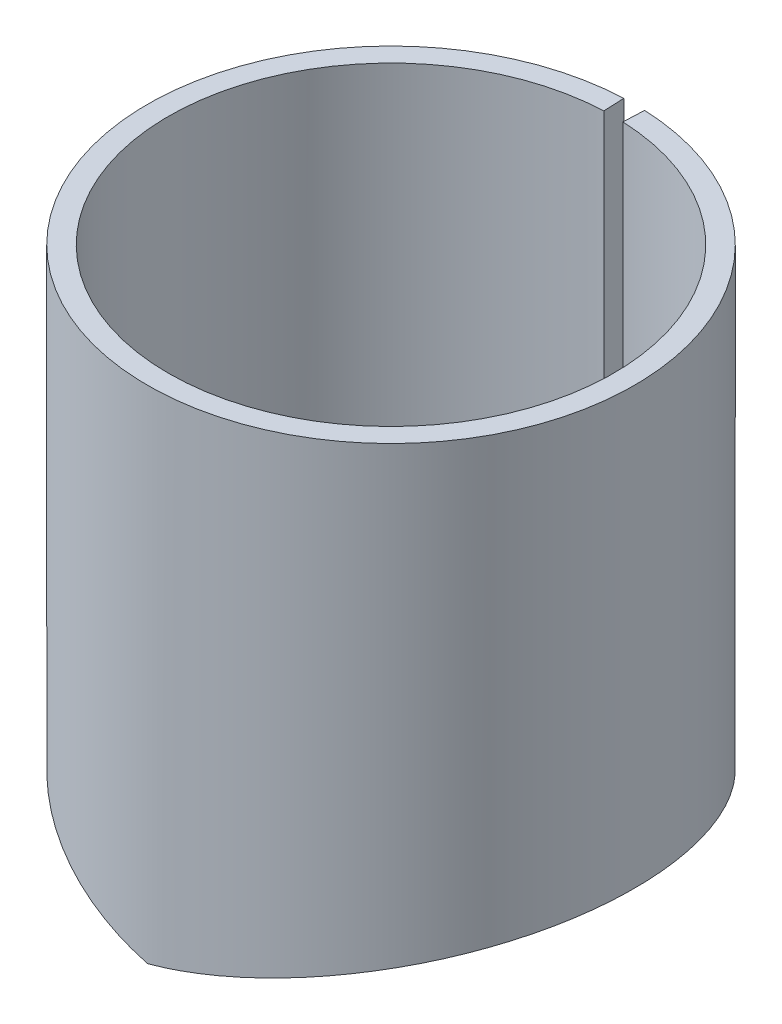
ISO-10303-21;
HEADER;
FILE_DESCRIPTION(('STEP AP214'),'2;1');
FILE_NAME('part.step','',(''),(''),'','','');
FILE_SCHEMA(('AUTOMOTIVE_DESIGN { 1 0 10303 214 1 1 1 1 }'));
ENDSEC;
DATA;
#1=APPLICATION_CONTEXT('core data for automotive mechanical design processes');
#2=APPLICATION_PROTOCOL_DEFINITION('international standard','automotive_design',2000,#1);
#3=PRODUCT_CONTEXT('',#1,'mechanical');
#4=PRODUCT('Part','Part','',(#3));
#5=PRODUCT_RELATED_PRODUCT_CATEGORY('part','',(#4));
#6=PRODUCT_DEFINITION_FORMATION('','',#4);
#7=PRODUCT_DEFINITION_CONTEXT('part definition',#1,'design');
#8=PRODUCT_DEFINITION('design','',#6,#7);
#9=PRODUCT_DEFINITION_SHAPE('','',#8);
#10=(LENGTH_UNIT() NAMED_UNIT(*) SI_UNIT(.MILLI.,.METRE.));
#11=(NAMED_UNIT(*) PLANE_ANGLE_UNIT() SI_UNIT($,.RADIAN.));
#12=(NAMED_UNIT(*) SI_UNIT($,.STERADIAN.) SOLID_ANGLE_UNIT());
#13=UNCERTAINTY_MEASURE_WITH_UNIT(LENGTH_MEASURE(1.E-05),#10,'distance_accuracy_value','');
#14=(GEOMETRIC_REPRESENTATION_CONTEXT(3) GLOBAL_UNCERTAINTY_ASSIGNED_CONTEXT((#13)) GLOBAL_UNIT_ASSIGNED_CONTEXT((#10,
#11,#12)) REPRESENTATION_CONTEXT('',''));
#15=CARTESIAN_POINT('',(0.,0.,0.));
#16=DIRECTION('',(0.,0.,1.));
#17=DIRECTION('',(1.,0.,0.));
#18=AXIS2_PLACEMENT_3D('',#15,#16,#17);
#19=CARTESIAN_POINT('',(0.,40.,0.));
#20=DIRECTION('',(0.,-1.,0.));
#21=DIRECTION('',(0.,0.,-1.));
#22=AXIS2_PLACEMENT_3D('',#19,#20,#21);
#23=PLANE('',#22);
#24=DIRECTION('',(0.0428602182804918,0.,-0.999081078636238));
#25=VECTOR('',#24,1.);
#26=CARTESIAN_POINT('',(0.457139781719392,40.,-10.6560284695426));
#27=LINE('',#26,#25);
#28=CARTESIAN_POINT('',(0.457139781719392,40.,-10.6560284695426));
#29=VERTEX_POINT('',#28);
#30=CARTESIAN_POINT('',(0.499999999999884,40.,-11.6551095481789));
#31=VERTEX_POINT('',#30);
#32=EDGE_CURVE('E13',#29,#31,#27,.T.);
#33=ORIENTED_EDGE('',*,*,#32,.F.);
#34=CARTESIAN_POINT('',(0.,40.,0.));
#35=DIRECTION('',(0.,1.,0.));
#36=DIRECTION('',(0.,0.,1.));
#37=AXIS2_PLACEMENT_3D('',#34,#35,#36);
#38=CIRCLE('',#37,10.6658295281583);
#39=CARTESIAN_POINT('',(-0.457139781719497,40.,-10.6560284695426));
#40=VERTEX_POINT('',#39);
#41=EDGE_CURVE('E85',#40,#29,#38,.T.);
#42=ORIENTED_EDGE('',*,*,#41,.F.);
#43=DIRECTION('',(-0.0428602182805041,0.,-0.999081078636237));
#44=VECTOR('',#43,1.);
#45=CARTESIAN_POINT('',(-0.457139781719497,40.,-10.6560284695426));
#46=LINE('',#45,#44);
#47=CARTESIAN_POINT('',(-0.500000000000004,40.,-11.6551095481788));
#48=VERTEX_POINT('',#47);
#49=EDGE_CURVE('E50',#40,#48,#46,.T.);
#50=ORIENTED_EDGE('',*,*,#49,.T.);
#51=CARTESIAN_POINT('',(0.,40.,0.));
#52=DIRECTION('',(0.,-1.,0.));
#53=DIRECTION('',(0.,0.,-1.));
#54=AXIS2_PLACEMENT_3D('',#51,#52,#53);
#55=CIRCLE('',#54,11.6658295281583);
#56=EDGE_CURVE('E87',#48,#31,#55,.F.);
#57=ORIENTED_EDGE('',*,*,#56,.T.);
#58=EDGE_LOOP('',(#33,#42,#50,#57));
#59=FACE_BOUND('',#58,.T.);
#60=ADVANCED_FACE('F38',(#59),#23,.F.);
#61=CARTESIAN_POINT('',(-0.457139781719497,28.0669872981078,-10.6560284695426));
#62=DIRECTION('',(-0.999081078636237,0.,0.0428602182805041));
#63=DIRECTION('',(0.,1.,0.));
#64=AXIS2_PLACEMENT_3D('',#61,#62,#63);
#65=PLANE('',#64);
#66=ORIENTED_EDGE('',*,*,#49,.F.);
#67=DIRECTION('',(0.,1.,0.));
#68=VECTOR('',#67,1.);
#69=CARTESIAN_POINT('',(-0.457139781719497,16.1339745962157,-10.6560284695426));
#70=LINE('',#69,#68);
#71=CARTESIAN_POINT('',(-0.457139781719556,16.1339745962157,-10.6560284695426));
#72=VERTEX_POINT('',#71);
#73=EDGE_CURVE('E95',#72,#40,#70,.T.);
#74=ORIENTED_EDGE('',*,*,#73,.F.);
#75=CARTESIAN_POINT('',(-0.500000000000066,16.1339745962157,-11.6551095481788));
#76=CARTESIAN_POINT('',(-0.457139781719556,16.1339745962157,-10.6560284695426));
#77=B_SPLINE_CURVE_WITH_KNOTS('',1,(#75,#76),.UNSPECIFIED.,.F.,.F.,(2,2),(0.,1.),.UNSPECIFIED.);
#78=CARTESIAN_POINT('',(-0.500000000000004,16.1339745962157,-11.6551095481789));
#79=VERTEX_POINT('',#78);
#80=EDGE_CURVE('E225',#72,#79,#77,.F.);
#81=ORIENTED_EDGE('',*,*,#80,.T.);
#82=DIRECTION('',(0.,-1.,0.));
#83=VECTOR('',#82,1.);
#84=CARTESIAN_POINT('',(-0.500000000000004,110.41051667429,-11.6551095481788));
#85=LINE('',#84,#83);
#86=EDGE_CURVE('E156',#79,#48,#85,.F.);
#87=ORIENTED_EDGE('',*,*,#86,.T.);
#88=EDGE_LOOP('',(#66,#74,#81,#87));
#89=FACE_BOUND('',#88,.T.);
#90=ADVANCED_FACE('F191',(#89),#65,.F.);
#91=CARTESIAN_POINT('',(0.,16.0000000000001,11.6658295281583));
#92=CARTESIAN_POINT('',(-0.483873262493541,16.1296508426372,11.6658295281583));
#93=CARTESIAN_POINT('',(-0.909811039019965,16.243575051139,11.6361509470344));
#94=CARTESIAN_POINT('',(-1.46003813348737,16.3910084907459,11.5755740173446));
#95=CARTESIAN_POINT('',(-1.62870277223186,16.4362365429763,11.5526270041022));
#96=CARTESIAN_POINT('',(-1.85971119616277,16.4982039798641,11.5169060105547));
#97=CARTESIAN_POINT('',(-1.93305126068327,16.5178806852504,11.5047771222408));
#98=CARTESIAN_POINT('',(-2.03759717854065,16.5459270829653,11.4865585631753));
#99=CARTESIAN_POINT('',(-2.07153519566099,16.5550311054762,11.4804811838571));
#100=CARTESIAN_POINT('',(-2.12108058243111,16.5683199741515,11.4713938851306));
#101=CARTESIAN_POINT('',(-2.13736877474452,16.5726884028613,11.4683695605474));
#102=CARTESIAN_POINT('',(-2.16146122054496,16.5791492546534,11.4638445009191));
#103=CARTESIAN_POINT('',(-2.16943539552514,16.581287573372,11.4623380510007));
#104=CARTESIAN_POINT('',(-2.1813117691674,16.5844721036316,11.4600817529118));
#105=CARTESIAN_POINT('',(-2.18525641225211,16.5855297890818,11.459330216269));
#106=CARTESIAN_POINT('',(-2.1911521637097,16.5871105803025,11.4582038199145));
#107=CARTESIAN_POINT('',(-2.19311387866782,16.5876365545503,11.4578285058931));
#108=CARTESIAN_POINT('',(-2.19605114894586,16.5884240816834,11.4572657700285));
#109=CARTESIAN_POINT('',(-2.19702935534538,16.588686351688,11.4570782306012));
#110=CARTESIAN_POINT('',(-2.1989840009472,16.5892104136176,11.4567032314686));
#111=CARTESIAN_POINT('',(-2.19938308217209,16.5893174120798,11.4566266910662));
#112=CARTESIAN_POINT('',(-2.598481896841,16.6963184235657,11.3799537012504));
#113=CARTESIAN_POINT('',(-2.97491583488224,16.797119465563,11.286204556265));
#114=CARTESIAN_POINT('',(-3.50694455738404,16.939645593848,11.1277651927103));
#115=CARTESIAN_POINT('',(-3.67886548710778,16.9857083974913,11.0719749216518));
#116=CARTESIAN_POINT('',(-3.92861474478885,17.0526337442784,10.9847776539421));
#117=CARTESIAN_POINT('',(-4.01050989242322,17.0745807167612,10.9551260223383));
#118=CARTESIAN_POINT('',(-4.13132711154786,17.1069589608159,10.9098837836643));
#119=CARTESIAN_POINT('',(-4.17126197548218,17.1176613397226,10.894675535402));
#120=CARTESIAN_POINT('',(-4.23065911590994,17.1335793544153,10.8716858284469));
#121=CARTESIAN_POINT('',(-4.25037397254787,17.1388627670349,10.8639930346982));
#122=CARTESIAN_POINT('',(-4.27982013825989,17.1467539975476,10.8524112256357));
#123=CARTESIAN_POINT('',(-4.28961450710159,17.149378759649,10.8485435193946));
#124=CARTESIAN_POINT('',(-4.30427455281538,17.1533074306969,10.842731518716));
#125=CARTESIAN_POINT('',(-4.30915598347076,17.1546155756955,10.8407924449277));
#126=CARTESIAN_POINT('',(-4.31647025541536,17.1565756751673,10.8378812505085));
#127=CARTESIAN_POINT('',(-4.31890703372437,17.1572286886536,10.8369104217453));
#128=CARTESIAN_POINT('',(-4.32377796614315,17.1585340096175,10.8349679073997));
#129=CARTESIAN_POINT('',(-4.32566755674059,17.1590403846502,10.8342138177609));
#130=CARTESIAN_POINT('',(-5.09086083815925,17.3640973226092,10.5284589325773));
#131=CARTESIAN_POINT('',(-5.78577971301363,17.5498171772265,10.1574532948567));
#132=CARTESIAN_POINT('',(-6.72159040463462,17.8005881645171,9.5420743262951));
#133=CARTESIAN_POINT('',(-7.01590314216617,17.8795436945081,9.32708784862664));
#134=CARTESIAN_POINT('',(-7.4312949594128,17.9910247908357,8.99438187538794));
#135=CARTESIAN_POINT('',(-7.56541912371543,18.0270264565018,8.88177127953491));
#136=CARTESIAN_POINT('',(-7.76019333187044,18.0792909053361,8.71082316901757));
#137=CARTESIAN_POINT('',(-7.82404973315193,18.0964227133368,8.653501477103));
#138=CARTESIAN_POINT('',(-7.91824692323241,18.1216859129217,8.56707418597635));
#139=CARTESIAN_POINT('',(-7.94938143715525,18.1300345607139,8.53819094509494));
#140=CARTESIAN_POINT('',(-7.9956884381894,18.1424489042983,8.49476266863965));
#141=CARTESIAN_POINT('',(-8.01105831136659,18.1465689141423,8.48026933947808));
#142=CARTESIAN_POINT('',(-8.03401469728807,18.1527217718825,8.4585044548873));
#143=CARTESIAN_POINT('',(-8.04165042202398,18.1547681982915,8.45124534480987));
#144=CARTESIAN_POINT('',(-8.05307943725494,18.1578310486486,8.44035057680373));
#145=CARTESIAN_POINT('',(-8.05688501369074,18.1588508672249,8.43671797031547));
#146=CARTESIAN_POINT('',(-8.06448798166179,18.1608882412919,8.42945074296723));
#147=CARTESIAN_POINT('',(-8.06760848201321,18.1617244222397,8.42646487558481));
#148=CARTESIAN_POINT('',(-8.64426339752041,18.3162404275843,7.87378094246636));
#149=CARTESIAN_POINT('',(-9.14770226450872,18.4508479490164,7.27912895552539));
#150=CARTESIAN_POINT('',(-9.79650282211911,18.6246932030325,6.34537313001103));
#151=CARTESIAN_POINT('',(-9.99511772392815,18.6779639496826,6.02713699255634));
#152=CARTESIAN_POINT('',(-10.2667645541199,18.7508535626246,5.54251018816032));
#153=CARTESIAN_POINT('',(-10.3529381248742,18.7739806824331,5.37975381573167));
#154=CARTESIAN_POINT('',(-10.4756936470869,18.8069172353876,5.13417922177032));
#155=CARTESIAN_POINT('',(-10.515528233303,18.8176037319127,5.05208087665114));
#156=CARTESIAN_POINT('',(-10.5736634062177,18.8331949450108,4.92861947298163));
#157=CARTESIAN_POINT('',(-10.5927723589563,18.8383189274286,4.88741334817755));
#158=CARTESIAN_POINT('',(-10.621032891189,18.8458952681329,4.82553138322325));
#159=CARTESIAN_POINT('',(-10.6303859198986,18.8484024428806,4.80489193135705));
#160=CARTESIAN_POINT('',(-10.6443149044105,18.8521357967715,4.773915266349));
#161=CARTESIAN_POINT('',(-10.648941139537,18.8533756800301,4.76358679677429));
#162=CARTESIAN_POINT('',(-10.6581601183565,18.8558463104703,4.7429241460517));
#163=CARTESIAN_POINT('',(-10.6624074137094,18.8569844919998,4.73337031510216));
#164=CARTESIAN_POINT('',(-10.9823023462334,18.9427029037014,4.01074396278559));
#165=CARTESIAN_POINT('',(-11.2235429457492,19.0071332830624,3.27288172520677));
#166=CARTESIAN_POINT('',(-11.4724390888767,19.0738249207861,2.14982395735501));
#167=CARTESIAN_POINT('',(-11.5366281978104,19.0910631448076,1.77275635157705));
#168=CARTESIAN_POINT('',(-11.6048943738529,19.1094319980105,1.20591223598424));
#169=CARTESIAN_POINT('',(-11.6229831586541,19.1143068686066,1.01675632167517));
#170=CARTESIAN_POINT('',(-11.6498867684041,19.1215604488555,0.63848978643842));
#171=CARTESIAN_POINT('',(-11.6586847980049,19.1239346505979,0.450132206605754));
#172=CARTESIAN_POINT('',(-11.6798621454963,19.1296103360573,-0.497940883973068));
#173=CARTESIAN_POINT('',(-11.6226755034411,19.114094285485,-1.26250739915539));
#174=CARTESIAN_POINT('',(-11.4235139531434,19.0607353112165,-2.39627640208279));
#175=CARTESIAN_POINT('',(-11.3382751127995,19.0379348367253,-2.77200591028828));
#176=CARTESIAN_POINT('',(-11.1822893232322,18.9962129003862,-3.32944653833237));
#177=CARTESIAN_POINT('',(-11.1256091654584,18.9810520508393,-3.51423410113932));
#178=CARTESIAN_POINT('',(-11.033607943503,18.9564304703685,-3.78951643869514));
#179=CARTESIAN_POINT('',(-11.0017775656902,18.9479098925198,-3.88096070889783));
#180=CARTESIAN_POINT('',(-10.9522945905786,18.9346589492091,-4.01760731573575));
#181=CARTESIAN_POINT('',(-10.9355107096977,18.9301636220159,-4.06306955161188));
#182=CARTESIAN_POINT('',(-10.9099016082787,18.9233031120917,-4.13112732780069));
#183=CARTESIAN_POINT('',(-10.9012930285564,18.9209966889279,-4.15379065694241));
#184=CARTESIAN_POINT('',(-10.8882719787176,18.9175076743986,-4.1877510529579));
#185=CARTESIAN_POINT('',(-10.8839135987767,18.9163397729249,-4.19906541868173));
#186=CARTESIAN_POINT('',(-10.8751608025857,18.9139941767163,-4.22168250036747));
#187=CARTESIAN_POINT('',(-10.8704953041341,18.9127438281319,-4.23367925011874));
#188=CARTESIAN_POINT('',(-10.6013081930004,18.8405978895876,-4.922861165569));
#189=CARTESIAN_POINT('',(-10.2668149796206,18.7507364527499,-5.59111724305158));
#190=CARTESIAN_POINT('',(-9.65830292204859,18.5877061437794,-6.5538453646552));
#191=CARTESIAN_POINT('',(-9.43772385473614,18.5286563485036,-6.86811280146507));
#192=CARTESIAN_POINT('',(-9.08045579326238,18.4330221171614,-7.32628198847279));
#193=CARTESIAN_POINT('',(-8.95697056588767,18.3999674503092,-7.47679825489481));
#194=CARTESIAN_POINT('',(-8.76521350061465,18.3486205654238,-7.69884242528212));
#195=CARTESIAN_POINT('',(-8.70020654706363,18.3312107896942,-7.77223537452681));
#196=CARTESIAN_POINT('',(-8.60107479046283,18.3046549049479,-7.88133907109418));
#197=CARTESIAN_POINT('',(-8.56776066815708,18.2957294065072,-7.91754267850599));
#198=CARTESIAN_POINT('',(-8.51738566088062,18.2822308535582,-7.97159498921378));
#199=CARTESIAN_POINT('',(-8.50052668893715,18.2777129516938,-7.9895702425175));
#200=CARTESIAN_POINT('',(-8.47513747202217,18.2709085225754,-8.01646901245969));
#201=CARTESIAN_POINT('',(-8.46665760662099,18.2686357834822,-8.02542458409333));
#202=CARTESIAN_POINT('',(-8.45391264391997,18.265219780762,-8.03884180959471));
#203=CARTESIAN_POINT('',(-8.44966012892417,18.2640799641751,-8.0433115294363));
#204=CARTESIAN_POINT('',(-8.44114671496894,18.2617980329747,-8.05224557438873));
#205=CARTESIAN_POINT('',(-8.43629342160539,18.2604971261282,-8.05732959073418));
#206=CARTESIAN_POINT('',(-7.96251584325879,18.1335003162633,-8.55293827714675));
#207=CARTESIAN_POINT('',(-7.4256275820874,17.9891964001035,-9.02833907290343));
#208=CARTESIAN_POINT('',(-6.5154430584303,17.7453031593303,-9.6840280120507));
#209=CARTESIAN_POINT('',(-6.19465421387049,17.6594325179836,-9.89295536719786));
#210=CARTESIAN_POINT('',(-5.68767529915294,17.5237672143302,-10.1872523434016));
#211=CARTESIAN_POINT('',(-5.51438996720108,17.4774022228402,-10.2821656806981));
#212=CARTESIAN_POINT('',(-5.24812724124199,17.4061399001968,-10.41915070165));
#213=CARTESIAN_POINT('',(-5.15831770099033,17.3820999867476,-10.4639147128));
#214=CARTESIAN_POINT('',(-5.02203797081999,17.3456114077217,-10.5296370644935));
#215=CARTESIAN_POINT('',(-4.97635052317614,17.333377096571,-10.551307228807));
#216=CARTESIAN_POINT('',(-4.90743053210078,17.3149184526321,-10.583446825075));
#217=CARTESIAN_POINT('',(-4.88439240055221,17.3087477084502,-10.5940990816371));
#218=CARTESIAN_POINT('',(-4.84973833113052,17.2994647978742,-10.6099848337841));
#219=CARTESIAN_POINT('',(-4.83817082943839,17.2963660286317,-10.615264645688));
#220=CARTESIAN_POINT('',(-4.82079540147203,17.291711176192,-10.6231610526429));
#221=CARTESIAN_POINT('',(-4.81499956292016,17.2901584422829,-10.6257893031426));
#222=CARTESIAN_POINT('',(-4.80339983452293,17.2870507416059,-10.6310380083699));
#223=CARTESIAN_POINT('',(-4.79659881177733,17.2852286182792,-10.6341076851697));
#224=CARTESIAN_POINT('',(-4.48389817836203,17.2014483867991,-10.7749836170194));
#225=CARTESIAN_POINT('',(-4.15500066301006,17.1132900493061,-10.9070976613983));
#226=CARTESIAN_POINT('',(-3.62971465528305,16.9725519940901,-11.0883298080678));
#227=CARTESIAN_POINT('',(-3.44930589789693,16.9242225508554,-11.1459084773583));
#228=CARTESIAN_POINT('',(-3.17077152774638,16.8496032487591,-11.227071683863));
#229=CARTESIAN_POINT('',(-3.07660731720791,16.8243759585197,-11.253258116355));
#230=CARTESIAN_POINT('',(-2.93339549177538,16.7860037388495,-11.2911118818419));
#231=CARTESIAN_POINT('',(-2.88533068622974,16.7731244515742,-11.3034921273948));
#232=CARTESIAN_POINT('',(-2.81274438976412,16.7536726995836,-11.3216902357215));
#233=CARTESIAN_POINT('',(-2.788467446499,16.7471666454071,-11.3276942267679));
#234=CARTESIAN_POINT('',(-2.75193007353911,16.7373743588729,-11.3366051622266));
#235=CARTESIAN_POINT('',(-2.73973062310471,16.73410472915,-11.3395596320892));
#236=CARTESIAN_POINT('',(-2.7214009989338,16.7291919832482,-11.3439673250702));
#237=CARTESIAN_POINT('',(-2.71528604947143,16.727553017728,-11.3454325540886));
#238=CARTESIAN_POINT('',(-2.70610601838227,16.7250924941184,-11.3476243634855));
#239=CARTESIAN_POINT('',(-2.70304474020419,16.7242719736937,-11.3483539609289));
#240=CARTESIAN_POINT('',(-2.69691964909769,16.7226302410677,-11.3498111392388));
#241=CARTESIAN_POINT('',(-2.69295809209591,16.7215683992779,-11.3507515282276));
#242=CARTESIAN_POINT('',(-2.41337177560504,16.6466286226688,-11.417026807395));
#243=CARTESIAN_POINT('',(-2.09254353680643,16.5605314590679,-11.4825578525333));
#244=CARTESIAN_POINT('',(-1.3623210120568,16.3648605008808,-11.5918917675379));
#245=CARTESIAN_POINT('',(-0.952917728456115,16.2553077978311,-11.6356795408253));
#246=CARTESIAN_POINT('',(-0.500000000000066,16.1339745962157,-11.6551095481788));
#247=CARTESIAN_POINT('',(0.,16.0000000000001,10.6658295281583));
#248=CARTESIAN_POINT('',(-0.442394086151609,16.1296504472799,10.6658295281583));
#249=CARTESIAN_POINT('',(-0.83182163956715,16.243575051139,10.6386950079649));
#250=CARTESIAN_POINT('',(-1.33488302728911,16.3910084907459,10.5833107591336));
#251=CARTESIAN_POINT('',(-1.48908965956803,16.4362365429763,10.5623307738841));
#252=CARTESIAN_POINT('',(-1.7002959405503,16.4982039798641,10.5296717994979));
#253=CARTESIAN_POINT('',(-1.7673492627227,16.5178806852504,10.5185826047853));
#254=CARTESIAN_POINT('',(-1.86293345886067,16.5459270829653,10.5019257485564));
#255=CARTESIAN_POINT('',(-1.89396229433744,16.5550311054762,10.4963693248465));
#256=CARTESIAN_POINT('',(-1.93926062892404,16.5683199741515,10.4880609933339));
#257=CARTESIAN_POINT('',(-1.95415259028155,16.5726884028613,10.4852959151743));
#258=CARTESIAN_POINT('',(-1.97617982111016,16.5791492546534,10.4811587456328));
#259=CARTESIAN_POINT('',(-1.98347044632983,16.581287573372,10.4797814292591));
#260=CARTESIAN_POINT('',(-1.99432877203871,16.5844721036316,10.4777185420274));
#261=CARTESIAN_POINT('',(-1.99793527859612,16.5855297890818,10.4770314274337));
#262=CARTESIAN_POINT('',(-2.00332564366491,16.5871105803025,10.4760015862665));
#263=CARTESIAN_POINT('',(-2.00511919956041,16.5876365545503,10.4756584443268));
#264=CARTESIAN_POINT('',(-2.00780468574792,16.5884240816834,10.4751439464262));
#265=CARTESIAN_POINT('',(-2.00869903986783,16.588686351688,10.4749724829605));
#266=CARTESIAN_POINT('',(-2.01048613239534,16.5892104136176,10.4746296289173));
#267=CARTESIAN_POINT('',(-2.01085100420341,16.5893174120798,10.4745596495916));
#268=CARTESIAN_POINT('',(-2.37573889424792,16.6963184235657,10.4044591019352));
#269=CARTESIAN_POINT('',(-2.71990475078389,16.797119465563,10.3187461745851));
#270=CARTESIAN_POINT('',(-3.20632773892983,16.939645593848,10.1738883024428));
#271=CARTESIAN_POINT('',(-3.36351153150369,16.9857083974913,10.1228803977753));
#272=CARTESIAN_POINT('',(-3.59185217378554,17.0526337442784,10.0431577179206));
#273=CARTESIAN_POINT('',(-3.66672723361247,17.0745807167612,10.0160478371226));
#274=CARTESIAN_POINT('',(-3.77718794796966,17.1069589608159,9.97468378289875));
#275=CARTESIAN_POINT('',(-3.81369957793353,17.1176613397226,9.96077919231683));
#276=CARTESIAN_POINT('',(-3.86800516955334,17.1335793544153,9.93976017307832));
#277=CARTESIAN_POINT('',(-3.88603006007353,17.1388627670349,9.93272680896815));
#278=CARTESIAN_POINT('',(-3.91295208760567,17.1467539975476,9.92213779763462));
#279=CARTESIAN_POINT('',(-3.92190687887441,17.149378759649,9.91860163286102));
#280=CARTESIAN_POINT('',(-3.93531025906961,17.1533074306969,9.91328783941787));
#281=CARTESIAN_POINT('',(-3.93977325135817,17.1546155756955,9.91151498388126));
#282=CARTESIAN_POINT('',(-3.94646054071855,17.1565756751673,9.90885333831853));
#283=CARTESIAN_POINT('',(-3.94868843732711,17.1572286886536,9.90796572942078));
#284=CARTESIAN_POINT('',(-3.9531418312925,17.1585340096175,9.90618972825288));
#285=CARTESIAN_POINT('',(-3.954869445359,17.1590403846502,9.90550027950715));
#286=CARTESIAN_POINT('',(-4.65447002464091,17.3640973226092,9.62595483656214));
#287=CARTESIAN_POINT('',(-5.28982015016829,17.5498171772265,9.2867519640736));
#288=CARTESIAN_POINT('',(-6.14541274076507,17.8005881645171,8.72412354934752));
#289=CARTESIAN_POINT('',(-6.41449686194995,17.8795436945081,8.52756580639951));
#290=CARTESIAN_POINT('',(-6.79428111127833,17.9910247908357,8.22337953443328));
#291=CARTESIAN_POINT('',(-6.91690809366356,18.0270264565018,8.12042196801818));
#292=CARTESIAN_POINT('',(-7.0949861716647,18.0792909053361,7.96412760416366));
#293=CARTESIAN_POINT('',(-7.15336877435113,18.0964227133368,7.91171955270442));
#294=CARTESIAN_POINT('',(-7.23949134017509,18.1216859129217,7.83270084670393));
#295=CARTESIAN_POINT('',(-7.26795698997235,18.1300345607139,7.80629348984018));
#296=CARTESIAN_POINT('',(-7.31029453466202,18.1424489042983,7.76658790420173));
#297=CARTESIAN_POINT('',(-7.32434689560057,18.1465689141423,7.75333694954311));
#298=CARTESIAN_POINT('',(-7.345335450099,18.1527217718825,7.73343776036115));
#299=CARTESIAN_POINT('',(-7.35231663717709,18.1547681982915,7.7268009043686));
#300=CARTESIAN_POINT('',(-7.36276595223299,18.1578310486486,7.71684004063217));
#301=CARTESIAN_POINT('',(-7.36624531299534,18.1588508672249,7.71351882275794));
#302=CARTESIAN_POINT('',(-7.37319655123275,18.1608882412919,7.70687454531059));
#303=CARTESIAN_POINT('',(-7.37604956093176,18.1617244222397,7.7041446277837));
#304=CARTESIAN_POINT('',(-7.90327336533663,18.3162404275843,7.19883700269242));
#305=CARTESIAN_POINT('',(-8.36355723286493,18.4508479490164,6.65515884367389));
#306=CARTESIAN_POINT('',(-8.95674232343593,18.6246932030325,5.80144497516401));
#307=CARTESIAN_POINT('',(-9.13833186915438,18.6779639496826,5.51048817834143));
#308=CARTESIAN_POINT('',(-9.38669301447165,18.7508535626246,5.0674037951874));
#309=CARTESIAN_POINT('',(-9.46547974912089,18.7739806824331,4.91859897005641));
#310=CARTESIAN_POINT('',(-9.57771261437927,18.8069172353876,4.69407513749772));
#311=CARTESIAN_POINT('',(-9.61413256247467,18.8176037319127,4.6190142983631));
#312=CARTESIAN_POINT('',(-9.66728436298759,18.8331949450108,4.50613606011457));
#313=CARTESIAN_POINT('',(-9.68475528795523,18.8383189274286,4.46846214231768));
#314=CARTESIAN_POINT('',(-9.71059331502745,18.8458952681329,4.41188472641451));
#315=CARTESIAN_POINT('',(-9.7191445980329,18.8484024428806,4.39301449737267));
#316=CARTESIAN_POINT('',(-9.73187958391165,18.8521357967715,4.36469316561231));
#317=CARTESIAN_POINT('',(-9.73610925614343,18.8533756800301,4.35525005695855));
#318=CARTESIAN_POINT('',(-9.7445379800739,18.8558463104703,4.33635861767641));
#319=CARTESIAN_POINT('',(-9.74842119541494,18.8569844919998,4.3276237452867));
#320=CARTESIAN_POINT('',(-10.0408945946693,18.9427029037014,3.66694123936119));
#321=CARTESIAN_POINT('',(-10.2614559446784,19.0071332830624,2.9923288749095));
#322=CARTESIAN_POINT('',(-10.4890166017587,19.0738249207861,1.96554010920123));
#323=CARTESIAN_POINT('',(-10.5477033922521,19.0910631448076,1.62079490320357));
#324=CARTESIAN_POINT('',(-10.6101177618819,19.1094319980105,1.10254091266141));
#325=CARTESIAN_POINT('',(-10.6266559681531,19.1143068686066,0.929599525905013));
#326=CARTESIAN_POINT('',(-10.6512533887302,19.1215604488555,0.583758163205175));
#327=CARTESIAN_POINT('',(-10.6592972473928,19.1239346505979,0.41154667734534));
#328=CARTESIAN_POINT('',(-10.678659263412,19.1296103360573,-0.455257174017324));
#329=CARTESIAN_POINT('',(-10.6263746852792,19.114094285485,-1.15428471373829));
#330=CARTESIAN_POINT('',(-10.4442853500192,19.0607353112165,-2.19086654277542));
#331=CARTESIAN_POINT('',(-10.3663532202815,19.0379348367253,-2.53438835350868));
#332=CARTESIAN_POINT('',(-10.2237386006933,18.9962129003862,-3.04404492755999));
#333=CARTESIAN_POINT('',(-10.1719170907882,18.9810520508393,-3.21299241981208));
#334=CARTESIAN_POINT('',(-10.0878022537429,18.9564304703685,-3.46467743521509));
#335=CARTESIAN_POINT('',(-10.0587003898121,18.9479098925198,-3.548283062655));
#336=CARTESIAN_POINT('',(-10.0134591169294,18.9346589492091,-3.67321626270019));
#337=CARTESIAN_POINT('',(-9.99811395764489,18.9301636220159,-3.71478145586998));
#338=CARTESIAN_POINT('',(-9.97470007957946,18.9233031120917,-3.77700528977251));
#339=CARTESIAN_POINT('',(-9.9668294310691,18.9209966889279,-3.79772590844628));
#340=CARTESIAN_POINT('',(-9.95492455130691,18.9175076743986,-3.82877520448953));
#341=CARTESIAN_POINT('',(-9.95093977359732,18.9163397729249,-3.83911969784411));
#342=CARTESIAN_POINT('',(-9.94293727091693,18.9139941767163,-3.85979803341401));
#343=CARTESIAN_POINT('',(-9.93867170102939,18.9127438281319,-3.87076641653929));
#344=CARTESIAN_POINT('',(-9.69255942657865,18.8405978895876,-4.50087135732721));
#345=CARTESIAN_POINT('',(-9.38673911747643,18.7507364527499,-5.11184423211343));
#346=CARTESIAN_POINT('',(-8.83038897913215,18.5877061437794,-5.99204687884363));
#347=CARTESIAN_POINT('',(-8.62871804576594,18.5286563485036,-6.27937517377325));
#348=CARTESIAN_POINT('',(-8.30207515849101,18.4330221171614,-6.69826989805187));
#349=CARTESIAN_POINT('',(-8.1891751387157,18.3999674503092,-6.83588384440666));
#350=CARTESIAN_POINT('',(-8.01385557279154,18.3486205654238,-7.03889429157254));
#351=CARTESIAN_POINT('',(-7.95442104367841,18.3312107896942,-7.10599596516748));
#352=CARTESIAN_POINT('',(-7.86378690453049,18.3046549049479,-7.20574724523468));
#353=CARTESIAN_POINT('',(-7.83332848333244,18.2957294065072,-7.23884746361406));
#354=CARTESIAN_POINT('',(-7.78727164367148,18.2822308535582,-7.28826638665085));
#355=CARTESIAN_POINT('',(-7.77185783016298,18.2777129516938,-7.30470079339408));
#356=CARTESIAN_POINT('',(-7.74864498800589,18.2709085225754,-7.32929378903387));
#357=CARTESIAN_POINT('',(-7.74089202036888,18.2686357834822,-7.33748168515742));
#358=CARTESIAN_POINT('',(-7.72923956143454,18.265219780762,-7.34974878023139));
#359=CARTESIAN_POINT('',(-7.72535157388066,18.2640799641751,-7.35383535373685));
#360=CARTESIAN_POINT('',(-7.7175679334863,18.2617980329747,-7.3620035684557));
#361=CARTESIAN_POINT('',(-7.71313066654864,18.2604971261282,-7.36665178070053));
#362=CARTESIAN_POINT('',(-7.27996550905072,18.1335003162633,-7.8197766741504));
#363=CARTESIAN_POINT('',(-6.78909954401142,17.9891964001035,-8.25442590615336));
#364=CARTESIAN_POINT('',(-5.95693643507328,17.7453031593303,-8.8539089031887));
#365=CARTESIAN_POINT('',(-5.66364575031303,17.6594325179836,-9.04492691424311));
#366=CARTESIAN_POINT('',(-5.2001252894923,17.5237672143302,-9.31399662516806));
#367=CARTESIAN_POINT('',(-5.04169405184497,17.4774022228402,-9.40077394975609));
#368=CARTESIAN_POINT('',(-4.79825548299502,17.4061399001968,-9.52601655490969));
#369=CARTESIAN_POINT('',(-4.71614445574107,17.3820999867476,-9.56694337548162));
#370=CARTESIAN_POINT('',(-4.59154668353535,17.3456114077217,-9.62703197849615));
#371=CARTESIAN_POINT('',(-4.54977558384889,17.333377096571,-9.6468445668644));
#372=CARTESIAN_POINT('',(-4.48676344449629,17.3149184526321,-9.67622914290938));
#373=CARTESIAN_POINT('',(-4.46570015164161,17.3087477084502,-9.6859682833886));
#374=CARTESIAN_POINT('',(-4.43401664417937,17.2994647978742,-9.70049230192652));
#375=CARTESIAN_POINT('',(-4.42344071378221,17.2963660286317,-9.70531952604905));
#376=CARTESIAN_POINT('',(-4.40755471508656,17.291711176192,-9.71253904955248));
#377=CARTESIAN_POINT('',(-4.40225569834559,17.2901584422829,-9.71494200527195));
#378=CARTESIAN_POINT('',(-4.39165030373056,17.2870507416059,-9.71974078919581));
#379=CARTESIAN_POINT('',(-4.38543226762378,17.2852286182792,-9.7225473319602));
#380=CARTESIAN_POINT('',(-4.09953646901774,17.2014483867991,-9.85134731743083));
#381=CARTESIAN_POINT('',(-3.79883219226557,17.1132900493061,-9.97213648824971));
#382=CARTESIAN_POINT('',(-3.31857393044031,16.9725519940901,-10.1378333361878));
#383=CARTESIAN_POINT('',(-3.15362989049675,16.9242225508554,-10.1904763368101));
#384=CARTESIAN_POINT('',(-2.89897160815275,16.8496032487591,-10.2646821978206));
#385=CARTESIAN_POINT('',(-2.81287919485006,16.8243759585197,-10.2886239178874));
#386=CARTESIAN_POINT('',(-2.68194354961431,16.7860037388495,-10.3232328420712));
#387=CARTESIAN_POINT('',(-2.63799888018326,16.7731244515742,-10.3345518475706));
#388=CARTESIAN_POINT('',(-2.57163471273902,16.7536726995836,-10.351190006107));
#389=CARTESIAN_POINT('',(-2.54943879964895,16.7471666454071,-10.3566793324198));
#390=CARTESIAN_POINT('',(-2.51603342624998,16.7373743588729,-10.3648264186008));
#391=CARTESIAN_POINT('',(-2.50487971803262,16.73410472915,-10.367527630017));
#392=CARTESIAN_POINT('',(-2.48812131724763,16.7291919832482,-10.3715574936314));
#393=CARTESIAN_POINT('',(-2.48253054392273,16.727553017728,-10.3728971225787));
#394=CARTESIAN_POINT('',(-2.47413742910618,16.7250924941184,-10.3749010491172));
#395=CARTESIAN_POINT('',(-2.47133856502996,16.7242719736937,-10.3755681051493));
#396=CARTESIAN_POINT('',(-2.46573851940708,16.7226302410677,-10.3769003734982));
#397=CARTESIAN_POINT('',(-2.46211654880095,16.7215683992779,-10.3777601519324));
#398=CARTESIAN_POINT('',(-2.20649649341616,16.6466286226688,-10.4383542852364));
#399=CARTESIAN_POINT('',(-1.91316979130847,16.5605314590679,-10.4982679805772));
#400=CARTESIAN_POINT('',(-1.24554226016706,16.3648605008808,-10.5982297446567));
#401=CARTESIAN_POINT('',(-0.871232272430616,16.2553075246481,-10.6382640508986));
#402=CARTESIAN_POINT('',(-0.457139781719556,16.1339745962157,-10.6560284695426));
#403=B_SPLINE_SURFACE_WITH_KNOTS('',1,3,((#91,#92,#93,#94,#95,#96,#97,#98,#99,#100,#101,#102,
#103,#104,#105,#106,#107,#108,#109,#110,#111,#112,#113,#114,#115,#116,#117,#118,#119,#120,#121,
#122,#123,#124,#125,#126,#127,#128,#129,#130,#131,#132,#133,#134,#135,#136,#137,#138,#139,#140,
#141,#142,#143,#144,#145,#146,#147,#148,#149,#150,#151,#152,#153,#154,#155,#156,#157,#158,#159,
#160,#161,#162,#163,#164,#165,#166,#167,#168,#169,#170,#171,#172,#173,#174,#175,#176,#177,#178,
#179,#180,#181,#182,#183,#184,#185,#186,#187,#188,#189,#190,#191,#192,#193,#194,#195,#196,#197,
#198,#199,#200,#201,#202,#203,#204,#205,#206,#207,#208,#209,#210,#211,#212,#213,#214,#215,#216,
#217,#218,#219,#220,#221,#222,#223,#224,#225,#226,#227,#228,#229,#230,#231,#232,#233,#234,#235,
#236,#237,#238,#239,#240,#241,#242,#243,#244,#245,#246),(#247,#248,#249,#250,#251,#252,#253,
#254,#255,#256,#257,#258,#259,#260,#261,#262,#263,#264,#265,#266,#267,#268,#269,#270,#271,#272,
#273,#274,#275,#276,#277,#278,#279,#280,#281,#282,#283,#284,#285,#286,#287,#288,#289,#290,#291,
#292,#293,#294,#295,#296,#297,#298,#299,#300,#301,#302,#303,#304,#305,#306,#307,#308,#309,#310,
#311,#312,#313,#314,#315,#316,#317,#318,#319,#320,#321,#322,#323,#324,#325,#326,#327,#328,#329,
#330,#331,#332,#333,#334,#335,#336,#337,#338,#339,#340,#341,#342,#343,#344,#345,#346,#347,#348,
#349,#350,#351,#352,#353,#354,#355,#356,#357,#358,#359,#360,#361,#362,#363,#364,#365,#366,#367,
#368,#369,#370,#371,#372,#373,#374,#375,#376,#377,#378,#379,#380,#381,#382,#383,#384,#385,#386,
#387,#388,#389,#390,#391,#392,#393,#394,#395,#396,#397,#398,#399,#400,#401,#402)),.UNSPECIFIED.,
.F.,.F.,.F.,(2,2),(4,2,2,2,2,2,2,2,2,2,2,2,2,2,2,2,2,2,2,2,2,2,2,2,2,2,2,2,2,2,2,2,2,2,2,2,2,2,
2,2,2,2,2,2,2,2,2,2,2,2,2,2,2,2,2,2,2,2,2,2,2,2,2,2,2,2,2,2,2,2,2,2,2,2,2,2,2,4),(0.,1.),(0.,
0.03125,0.046875,0.0546875,0.05859375,0.060546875,0.0615234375,0.06201171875,0.062255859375,
0.0623779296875,0.0625,0.09375,0.109375,0.1171875,0.12109375,0.123046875,0.1240234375,
0.12451171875,0.124755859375,0.125,0.1875,0.21875,0.234375,0.2421875,0.24609375,0.248046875,
0.2490234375,0.24951171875,0.25,0.3125,0.34375,0.359375,0.3671875,0.37109375,0.373046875,
0.3740234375,0.375,0.4375,0.46875,0.484375,0.5,0.5625,0.59375,0.609375,0.6171875,0.62109375,
0.623046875,0.6240234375,0.625,0.6875,0.71875,0.734375,0.7421875,0.74609375,0.748046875,
0.7490234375,0.74951171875,0.75,0.8125,0.84375,0.859375,0.8671875,0.87109375,0.873046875,
0.8740234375,0.87451171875,0.875,0.90625,0.921875,0.9296875,0.93359375,0.935546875,0.9365234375,
0.93701171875,0.937255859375,0.9375,0.96875,1.),.UNSPECIFIED.);
#404=CARTESIAN_POINT('',(-0.457139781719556,16.1339745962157,-10.6560284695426));
#405=CARTESIAN_POINT('',(-0.871232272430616,16.2553075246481,-10.6382640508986));
#406=CARTESIAN_POINT('',(-1.24554226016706,16.3648605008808,-10.5982297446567));
#407=CARTESIAN_POINT('',(-1.91316979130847,16.5605314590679,-10.4982679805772));
#408=CARTESIAN_POINT('',(-2.20649649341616,16.6466286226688,-10.4383542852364));
#409=CARTESIAN_POINT('',(-2.46211654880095,16.7215683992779,-10.3777601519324));
#410=CARTESIAN_POINT('',(-2.46573851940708,16.7226302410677,-10.3769003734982));
#411=CARTESIAN_POINT('',(-2.47133856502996,16.7242719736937,-10.3755681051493));
#412=CARTESIAN_POINT('',(-2.47413742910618,16.7250924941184,-10.3749010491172));
#413=CARTESIAN_POINT('',(-2.48253054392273,16.727553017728,-10.3728971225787));
#414=CARTESIAN_POINT('',(-2.48812131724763,16.7291919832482,-10.3715574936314));
#415=CARTESIAN_POINT('',(-2.50487971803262,16.73410472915,-10.367527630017));
#416=CARTESIAN_POINT('',(-2.51603342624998,16.7373743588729,-10.3648264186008));
#417=CARTESIAN_POINT('',(-2.54943879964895,16.7471666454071,-10.3566793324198));
#418=CARTESIAN_POINT('',(-2.57163471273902,16.7536726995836,-10.351190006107));
#419=CARTESIAN_POINT('',(-2.63799888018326,16.7731244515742,-10.3345518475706));
#420=CARTESIAN_POINT('',(-2.68194354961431,16.7860037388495,-10.3232328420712));
#421=CARTESIAN_POINT('',(-2.81287919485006,16.8243759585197,-10.2886239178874));
#422=CARTESIAN_POINT('',(-2.89897160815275,16.8496032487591,-10.2646821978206));
#423=CARTESIAN_POINT('',(-3.15362989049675,16.9242225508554,-10.1904763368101));
#424=CARTESIAN_POINT('',(-3.31857393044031,16.9725519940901,-10.1378333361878));
#425=CARTESIAN_POINT('',(-3.79883219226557,17.1132900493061,-9.97213648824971));
#426=CARTESIAN_POINT('',(-4.09953646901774,17.2014483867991,-9.85134731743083));
#427=CARTESIAN_POINT('',(-4.38543226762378,17.2852286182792,-9.7225473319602));
#428=CARTESIAN_POINT('',(-4.39165030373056,17.2870507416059,-9.71974078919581));
#429=CARTESIAN_POINT('',(-4.40225569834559,17.2901584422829,-9.71494200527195));
#430=CARTESIAN_POINT('',(-4.40755471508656,17.291711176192,-9.71253904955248));
#431=CARTESIAN_POINT('',(-4.42344071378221,17.2963660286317,-9.70531952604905));
#432=CARTESIAN_POINT('',(-4.43401664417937,17.2994647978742,-9.70049230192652));
#433=CARTESIAN_POINT('',(-4.46570015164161,17.3087477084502,-9.6859682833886));
#434=CARTESIAN_POINT('',(-4.48676344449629,17.3149184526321,-9.67622914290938));
#435=CARTESIAN_POINT('',(-4.54977558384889,17.333377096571,-9.6468445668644));
#436=CARTESIAN_POINT('',(-4.59154668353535,17.3456114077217,-9.62703197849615));
#437=CARTESIAN_POINT('',(-4.71614445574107,17.3820999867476,-9.56694337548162));
#438=CARTESIAN_POINT('',(-4.79825548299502,17.4061399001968,-9.52601655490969));
#439=CARTESIAN_POINT('',(-5.04169405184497,17.4774022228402,-9.40077394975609));
#440=CARTESIAN_POINT('',(-5.2001252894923,17.5237672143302,-9.31399662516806));
#441=CARTESIAN_POINT('',(-5.66364575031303,17.6594325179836,-9.04492691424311));
#442=CARTESIAN_POINT('',(-5.95693643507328,17.7453031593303,-8.8539089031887));
#443=CARTESIAN_POINT('',(-6.78909954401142,17.9891964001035,-8.25442590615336));
#444=CARTESIAN_POINT('',(-7.27996550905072,18.1335003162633,-7.8197766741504));
#445=CARTESIAN_POINT('',(-7.71313066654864,18.2604971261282,-7.36665178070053));
#446=CARTESIAN_POINT('',(-7.7175679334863,18.2617980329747,-7.3620035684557));
#447=CARTESIAN_POINT('',(-7.72535157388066,18.2640799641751,-7.35383535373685));
#448=CARTESIAN_POINT('',(-7.72923956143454,18.265219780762,-7.34974878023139));
#449=CARTESIAN_POINT('',(-7.74089202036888,18.2686357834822,-7.33748168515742));
#450=CARTESIAN_POINT('',(-7.74864498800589,18.2709085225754,-7.32929378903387));
#451=CARTESIAN_POINT('',(-7.77185783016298,18.2777129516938,-7.30470079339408));
#452=CARTESIAN_POINT('',(-7.78727164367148,18.2822308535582,-7.28826638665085));
#453=CARTESIAN_POINT('',(-7.83332848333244,18.2957294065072,-7.23884746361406));
#454=CARTESIAN_POINT('',(-7.86378690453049,18.3046549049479,-7.20574724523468));
#455=CARTESIAN_POINT('',(-7.95442104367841,18.3312107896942,-7.10599596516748));
#456=CARTESIAN_POINT('',(-8.01385557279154,18.3486205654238,-7.03889429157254));
#457=CARTESIAN_POINT('',(-8.1891751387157,18.3999674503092,-6.83588384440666));
#458=CARTESIAN_POINT('',(-8.30207515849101,18.4330221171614,-6.69826989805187));
#459=CARTESIAN_POINT('',(-8.62871804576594,18.5286563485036,-6.27937517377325));
#460=CARTESIAN_POINT('',(-8.83038897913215,18.5877061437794,-5.99204687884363));
#461=CARTESIAN_POINT('',(-9.38673911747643,18.7507364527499,-5.11184423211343));
#462=CARTESIAN_POINT('',(-9.69255942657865,18.8405978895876,-4.50087135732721));
#463=CARTESIAN_POINT('',(-9.93867170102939,18.9127438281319,-3.87076641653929));
#464=CARTESIAN_POINT('',(-9.94293727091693,18.9139941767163,-3.85979803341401));
#465=CARTESIAN_POINT('',(-9.95093977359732,18.9163397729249,-3.83911969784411));
#466=CARTESIAN_POINT('',(-9.95492455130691,18.9175076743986,-3.82877520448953));
#467=CARTESIAN_POINT('',(-9.9668294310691,18.9209966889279,-3.79772590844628));
#468=CARTESIAN_POINT('',(-9.97470007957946,18.9233031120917,-3.77700528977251));
#469=CARTESIAN_POINT('',(-9.99811395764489,18.9301636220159,-3.71478145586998));
#470=CARTESIAN_POINT('',(-10.0134591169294,18.9346589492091,-3.67321626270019));
#471=CARTESIAN_POINT('',(-10.0587003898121,18.9479098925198,-3.548283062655));
#472=CARTESIAN_POINT('',(-10.0878022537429,18.9564304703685,-3.46467743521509));
#473=CARTESIAN_POINT('',(-10.1719170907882,18.9810520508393,-3.21299241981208));
#474=CARTESIAN_POINT('',(-10.2237386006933,18.9962129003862,-3.04404492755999));
#475=CARTESIAN_POINT('',(-10.3663532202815,19.0379348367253,-2.53438835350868));
#476=CARTESIAN_POINT('',(-10.4442853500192,19.0607353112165,-2.19086654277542));
#477=CARTESIAN_POINT('',(-10.6263746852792,19.114094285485,-1.15428471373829));
#478=CARTESIAN_POINT('',(-10.678659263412,19.1296103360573,-0.455257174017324));
#479=CARTESIAN_POINT('',(-10.6592972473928,19.1239346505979,0.41154667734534));
#480=CARTESIAN_POINT('',(-10.6512533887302,19.1215604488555,0.583758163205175));
#481=CARTESIAN_POINT('',(-10.6266559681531,19.1143068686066,0.929599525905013));
#482=CARTESIAN_POINT('',(-10.6101177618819,19.1094319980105,1.10254091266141));
#483=CARTESIAN_POINT('',(-10.5477033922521,19.0910631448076,1.62079490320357));
#484=CARTESIAN_POINT('',(-10.4890166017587,19.0738249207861,1.96554010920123));
#485=CARTESIAN_POINT('',(-10.2614559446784,19.0071332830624,2.9923288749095));
#486=CARTESIAN_POINT('',(-10.0408945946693,18.9427029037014,3.66694123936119));
#487=CARTESIAN_POINT('',(-9.74842119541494,18.8569844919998,4.3276237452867));
#488=CARTESIAN_POINT('',(-9.7445379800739,18.8558463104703,4.33635861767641));
#489=CARTESIAN_POINT('',(-9.73610925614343,18.8533756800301,4.35525005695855));
#490=CARTESIAN_POINT('',(-9.73187958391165,18.8521357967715,4.36469316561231));
#491=CARTESIAN_POINT('',(-9.7191445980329,18.8484024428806,4.39301449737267));
#492=CARTESIAN_POINT('',(-9.71059331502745,18.8458952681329,4.41188472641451));
#493=CARTESIAN_POINT('',(-9.68475528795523,18.8383189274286,4.46846214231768));
#494=CARTESIAN_POINT('',(-9.66728436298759,18.8331949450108,4.50613606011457));
#495=CARTESIAN_POINT('',(-9.61413256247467,18.8176037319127,4.6190142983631));
#496=CARTESIAN_POINT('',(-9.57771261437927,18.8069172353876,4.69407513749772));
#497=CARTESIAN_POINT('',(-9.46547974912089,18.7739806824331,4.91859897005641));
#498=CARTESIAN_POINT('',(-9.38669301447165,18.7508535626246,5.0674037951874));
#499=CARTESIAN_POINT('',(-9.13833186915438,18.6779639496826,5.51048817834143));
#500=CARTESIAN_POINT('',(-8.95674232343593,18.6246932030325,5.80144497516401));
#501=CARTESIAN_POINT('',(-8.36355723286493,18.4508479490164,6.65515884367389));
#502=CARTESIAN_POINT('',(-7.90327336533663,18.3162404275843,7.19883700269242));
#503=CARTESIAN_POINT('',(-7.37604956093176,18.1617244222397,7.7041446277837));
#504=CARTESIAN_POINT('',(-7.37319655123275,18.1608882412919,7.70687454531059));
#505=CARTESIAN_POINT('',(-7.36624531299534,18.1588508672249,7.71351882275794));
#506=CARTESIAN_POINT('',(-7.36276595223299,18.1578310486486,7.71684004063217));
#507=CARTESIAN_POINT('',(-7.35231663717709,18.1547681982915,7.7268009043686));
#508=CARTESIAN_POINT('',(-7.345335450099,18.1527217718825,7.73343776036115));
#509=CARTESIAN_POINT('',(-7.32434689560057,18.1465689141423,7.75333694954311));
#510=CARTESIAN_POINT('',(-7.31029453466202,18.1424489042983,7.76658790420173));
#511=CARTESIAN_POINT('',(-7.26795698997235,18.1300345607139,7.80629348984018));
#512=CARTESIAN_POINT('',(-7.23949134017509,18.1216859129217,7.83270084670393));
#513=CARTESIAN_POINT('',(-7.15336877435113,18.0964227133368,7.91171955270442));
#514=CARTESIAN_POINT('',(-7.0949861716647,18.0792909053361,7.96412760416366));
#515=CARTESIAN_POINT('',(-6.91690809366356,18.0270264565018,8.12042196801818));
#516=CARTESIAN_POINT('',(-6.79428111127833,17.9910247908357,8.22337953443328));
#517=CARTESIAN_POINT('',(-6.41449686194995,17.8795436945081,8.52756580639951));
#518=CARTESIAN_POINT('',(-6.14541274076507,17.8005881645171,8.72412354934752));
#519=CARTESIAN_POINT('',(-5.28982015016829,17.5498171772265,9.2867519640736));
#520=CARTESIAN_POINT('',(-4.65447002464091,17.3640973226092,9.62595483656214));
#521=CARTESIAN_POINT('',(-3.954869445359,17.1590403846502,9.90550027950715));
#522=CARTESIAN_POINT('',(-3.9531418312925,17.1585340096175,9.90618972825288));
#523=CARTESIAN_POINT('',(-3.94868843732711,17.1572286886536,9.90796572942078));
#524=CARTESIAN_POINT('',(-3.94646054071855,17.1565756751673,9.90885333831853));
#525=CARTESIAN_POINT('',(-3.93977325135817,17.1546155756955,9.91151498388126));
#526=CARTESIAN_POINT('',(-3.93531025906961,17.1533074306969,9.91328783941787));
#527=CARTESIAN_POINT('',(-3.92190687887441,17.149378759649,9.91860163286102));
#528=CARTESIAN_POINT('',(-3.91295208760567,17.1467539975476,9.92213779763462));
#529=CARTESIAN_POINT('',(-3.88603006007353,17.1388627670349,9.93272680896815));
#530=CARTESIAN_POINT('',(-3.86800516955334,17.1335793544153,9.93976017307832));
#531=CARTESIAN_POINT('',(-3.81369957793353,17.1176613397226,9.96077919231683));
#532=CARTESIAN_POINT('',(-3.77718794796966,17.1069589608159,9.97468378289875));
#533=CARTESIAN_POINT('',(-3.66672723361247,17.0745807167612,10.0160478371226));
#534=CARTESIAN_POINT('',(-3.59185217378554,17.0526337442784,10.0431577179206));
#535=CARTESIAN_POINT('',(-3.36351153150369,16.9857083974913,10.1228803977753));
#536=CARTESIAN_POINT('',(-3.20632773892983,16.939645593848,10.1738883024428));
#537=CARTESIAN_POINT('',(-2.71990475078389,16.797119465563,10.3187461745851));
#538=CARTESIAN_POINT('',(-2.37573889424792,16.6963184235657,10.4044591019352));
#539=CARTESIAN_POINT('',(-2.01085100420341,16.5893174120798,10.4745596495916));
#540=CARTESIAN_POINT('',(-2.01048613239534,16.5892104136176,10.4746296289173));
#541=CARTESIAN_POINT('',(-2.00869903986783,16.588686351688,10.4749724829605));
#542=CARTESIAN_POINT('',(-2.00780468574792,16.5884240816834,10.4751439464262));
#543=CARTESIAN_POINT('',(-2.00511919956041,16.5876365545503,10.4756584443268));
#544=CARTESIAN_POINT('',(-2.00332564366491,16.5871105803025,10.4760015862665));
#545=CARTESIAN_POINT('',(-1.99793527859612,16.5855297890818,10.4770314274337));
#546=CARTESIAN_POINT('',(-1.99432877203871,16.5844721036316,10.4777185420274));
#547=CARTESIAN_POINT('',(-1.98347044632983,16.581287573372,10.4797814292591));
#548=CARTESIAN_POINT('',(-1.97617982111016,16.5791492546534,10.4811587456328));
#549=CARTESIAN_POINT('',(-1.95415259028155,16.5726884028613,10.4852959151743));
#550=CARTESIAN_POINT('',(-1.93926062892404,16.5683199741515,10.4880609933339));
#551=CARTESIAN_POINT('',(-1.89396229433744,16.5550311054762,10.4963693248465));
#552=CARTESIAN_POINT('',(-1.86293345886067,16.5459270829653,10.5019257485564));
#553=CARTESIAN_POINT('',(-1.7673492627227,16.5178806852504,10.5185826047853));
#554=CARTESIAN_POINT('',(-1.7002959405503,16.4982039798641,10.5296717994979));
#555=CARTESIAN_POINT('',(-1.48908965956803,16.4362365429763,10.5623307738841));
#556=CARTESIAN_POINT('',(-1.33488302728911,16.3910084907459,10.5833107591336));
#557=CARTESIAN_POINT('',(-0.83182163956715,16.243575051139,10.6386950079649));
#558=CARTESIAN_POINT('',(-0.442394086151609,16.1296504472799,10.6658295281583));
#559=CARTESIAN_POINT('',(0.,16.0000000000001,10.6658295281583));
#560=B_SPLINE_CURVE_WITH_KNOTS('',3,(#404,#405,#406,#407,#408,#409,#410,#411,#412,#413,#414,
#415,#416,#417,#418,#419,#420,#421,#422,#423,#424,#425,#426,#427,#428,#429,#430,#431,#432,#433,
#434,#435,#436,#437,#438,#439,#440,#441,#442,#443,#444,#445,#446,#447,#448,#449,#450,#451,#452,
#453,#454,#455,#456,#457,#458,#459,#460,#461,#462,#463,#464,#465,#466,#467,#468,#469,#470,#471,
#472,#473,#474,#475,#476,#477,#478,#479,#480,#481,#482,#483,#484,#485,#486,#487,#488,#489,#490,
#491,#492,#493,#494,#495,#496,#497,#498,#499,#500,#501,#502,#503,#504,#505,#506,#507,#508,#509,
#510,#511,#512,#513,#514,#515,#516,#517,#518,#519,#520,#521,#522,#523,#524,#525,#526,#527,#528,
#529,#530,#531,#532,#533,#534,#535,#536,#537,#538,#539,#540,#541,#542,#543,#544,#545,#546,#547,
#548,#549,#550,#551,#552,#553,#554,#555,#556,#557,#558,#559),.UNSPECIFIED.,.F.,.F.,(4,2,2,2,2,2,
2,2,2,2,2,2,2,2,2,2,2,2,2,2,2,2,2,2,2,2,2,2,2,2,2,2,2,2,2,2,2,2,2,2,2,2,2,2,2,2,2,2,2,2,2,2,2,2,
2,2,2,2,2,2,2,2,2,2,2,2,2,2,2,2,2,2,2,2,2,2,2,4),(0.,0.03125,0.0625,0.062744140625,
0.06298828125,0.0634765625,0.064453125,0.06640625,0.0703125,0.078125,0.09375,0.125,
0.12548828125,0.1259765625,0.126953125,0.12890625,0.1328125,0.140625,0.15625,0.1875,0.25,
0.25048828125,0.2509765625,0.251953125,0.25390625,0.2578125,0.265625,0.28125,0.3125,0.375,
0.3759765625,0.376953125,0.37890625,0.3828125,0.390625,0.40625,0.4375,0.5,0.515625,0.53125,
0.5625,0.625,0.6259765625,0.626953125,0.62890625,0.6328125,0.640625,0.65625,0.6875,0.75,
0.75048828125,0.7509765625,0.751953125,0.75390625,0.7578125,0.765625,0.78125,0.8125,0.875,
0.875244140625,0.87548828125,0.8759765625,0.876953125,0.87890625,0.8828125,0.890625,0.90625,
0.9375,0.9376220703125,0.937744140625,0.93798828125,0.9384765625,0.939453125,0.94140625,
0.9453125,0.953125,0.96875,1.),.UNSPECIFIED.);
#561=CARTESIAN_POINT('',(0.,16.0000000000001,10.6658295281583));
#562=VERTEX_POINT('',#561);
#563=EDGE_CURVE('E169',#562,#72,#560,.F.);
#564=CARTESIAN_POINT('',(0.,16.0000000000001,10.6658295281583));
#565=CARTESIAN_POINT('',(0.,16.0000000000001,11.6658295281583));
#566=B_SPLINE_CURVE_WITH_KNOTS('',1,(#564,#565),.UNSPECIFIED.,.F.,.F.,(2,2),(0.,1.),.UNSPECIFIED.);
#567=CARTESIAN_POINT('',(-9.33035475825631E-07,16.0000002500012,11.6658295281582));
#568=VERTEX_POINT('',#567);
#569=EDGE_CURVE('E155',#562,#568,#566,.T.);
#570=CARTESIAN_POINT('',(0.,16.0000000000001,11.6658295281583));
#571=CARTESIAN_POINT('',(-0.483873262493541,16.1296508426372,11.6658295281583));
#572=CARTESIAN_POINT('',(-0.909811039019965,16.243575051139,11.6361509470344));
#573=CARTESIAN_POINT('',(-1.46003813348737,16.3910084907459,11.5755740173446));
#574=CARTESIAN_POINT('',(-1.62870277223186,16.4362365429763,11.5526270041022));
#575=CARTESIAN_POINT('',(-1.85971119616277,16.4982039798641,11.5169060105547));
#576=CARTESIAN_POINT('',(-1.93305126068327,16.5178806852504,11.5047771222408));
#577=CARTESIAN_POINT('',(-2.03759717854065,16.5459270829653,11.4865585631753));
#578=CARTESIAN_POINT('',(-2.07153519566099,16.5550311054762,11.4804811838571));
#579=CARTESIAN_POINT('',(-2.12108058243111,16.5683199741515,11.4713938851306));
#580=CARTESIAN_POINT('',(-2.13736877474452,16.5726884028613,11.4683695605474));
#581=CARTESIAN_POINT('',(-2.16146122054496,16.5791492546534,11.4638445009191));
#582=CARTESIAN_POINT('',(-2.16943539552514,16.581287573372,11.4623380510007));
#583=CARTESIAN_POINT('',(-2.1813117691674,16.5844721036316,11.4600817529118));
#584=CARTESIAN_POINT('',(-2.18525641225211,16.5855297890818,11.459330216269));
#585=CARTESIAN_POINT('',(-2.1911521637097,16.5871105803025,11.4582038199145));
#586=CARTESIAN_POINT('',(-2.19311387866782,16.5876365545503,11.4578285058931));
#587=CARTESIAN_POINT('',(-2.19605114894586,16.5884240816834,11.4572657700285));
#588=CARTESIAN_POINT('',(-2.19702935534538,16.588686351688,11.4570782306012));
#589=CARTESIAN_POINT('',(-2.1989840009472,16.5892104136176,11.4567032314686));
#590=CARTESIAN_POINT('',(-2.19938308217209,16.5893174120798,11.4566266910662));
#591=CARTESIAN_POINT('',(-2.598481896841,16.6963184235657,11.3799537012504));
#592=CARTESIAN_POINT('',(-2.97491583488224,16.797119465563,11.286204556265));
#593=CARTESIAN_POINT('',(-3.50694455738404,16.939645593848,11.1277651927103));
#594=CARTESIAN_POINT('',(-3.67886548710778,16.9857083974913,11.0719749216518));
#595=CARTESIAN_POINT('',(-3.92861474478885,17.0526337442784,10.9847776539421));
#596=CARTESIAN_POINT('',(-4.01050989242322,17.0745807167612,10.9551260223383));
#597=CARTESIAN_POINT('',(-4.13132711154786,17.1069589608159,10.9098837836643));
#598=CARTESIAN_POINT('',(-4.17126197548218,17.1176613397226,10.894675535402));
#599=CARTESIAN_POINT('',(-4.23065911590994,17.1335793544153,10.8716858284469));
#600=CARTESIAN_POINT('',(-4.25037397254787,17.1388627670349,10.8639930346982));
#601=CARTESIAN_POINT('',(-4.27982013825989,17.1467539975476,10.8524112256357));
#602=CARTESIAN_POINT('',(-4.28961450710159,17.149378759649,10.8485435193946));
#603=CARTESIAN_POINT('',(-4.30427455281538,17.1533074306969,10.842731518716));
#604=CARTESIAN_POINT('',(-4.30915598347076,17.1546155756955,10.8407924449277));
#605=CARTESIAN_POINT('',(-4.31647025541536,17.1565756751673,10.8378812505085));
#606=CARTESIAN_POINT('',(-4.31890703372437,17.1572286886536,10.8369104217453));
#607=CARTESIAN_POINT('',(-4.32377796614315,17.1585340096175,10.8349679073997));
#608=CARTESIAN_POINT('',(-4.32566755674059,17.1590403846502,10.8342138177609));
#609=CARTESIAN_POINT('',(-5.09086083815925,17.3640973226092,10.5284589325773));
#610=CARTESIAN_POINT('',(-5.78577971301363,17.5498171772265,10.1574532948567));
#611=CARTESIAN_POINT('',(-6.72159040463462,17.8005881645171,9.5420743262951));
#612=CARTESIAN_POINT('',(-7.01590314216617,17.8795436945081,9.32708784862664));
#613=CARTESIAN_POINT('',(-7.4312949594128,17.9910247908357,8.99438187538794));
#614=CARTESIAN_POINT('',(-7.56541912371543,18.0270264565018,8.88177127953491));
#615=CARTESIAN_POINT('',(-7.76019333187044,18.0792909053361,8.71082316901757));
#616=CARTESIAN_POINT('',(-7.82404973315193,18.0964227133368,8.653501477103));
#617=CARTESIAN_POINT('',(-7.91824692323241,18.1216859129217,8.56707418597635));
#618=CARTESIAN_POINT('',(-7.94938143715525,18.1300345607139,8.53819094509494));
#619=CARTESIAN_POINT('',(-7.9956884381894,18.1424489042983,8.49476266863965));
#620=CARTESIAN_POINT('',(-8.01105831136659,18.1465689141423,8.48026933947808));
#621=CARTESIAN_POINT('',(-8.03401469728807,18.1527217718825,8.4585044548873));
#622=CARTESIAN_POINT('',(-8.04165042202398,18.1547681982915,8.45124534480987));
#623=CARTESIAN_POINT('',(-8.05307943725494,18.1578310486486,8.44035057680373));
#624=CARTESIAN_POINT('',(-8.05688501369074,18.1588508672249,8.43671797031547));
#625=CARTESIAN_POINT('',(-8.06448798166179,18.1608882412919,8.42945074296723));
#626=CARTESIAN_POINT('',(-8.06760848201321,18.1617244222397,8.42646487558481));
#627=CARTESIAN_POINT('',(-8.64426339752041,18.3162404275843,7.87378094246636));
#628=CARTESIAN_POINT('',(-9.14770226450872,18.4508479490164,7.27912895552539));
#629=CARTESIAN_POINT('',(-9.79650282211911,18.6246932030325,6.34537313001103));
#630=CARTESIAN_POINT('',(-9.99511772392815,18.6779639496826,6.02713699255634));
#631=CARTESIAN_POINT('',(-10.2667645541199,18.7508535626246,5.54251018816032));
#632=CARTESIAN_POINT('',(-10.3529381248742,18.7739806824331,5.37975381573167));
#633=CARTESIAN_POINT('',(-10.4756936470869,18.8069172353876,5.13417922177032));
#634=CARTESIAN_POINT('',(-10.515528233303,18.8176037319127,5.05208087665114));
#635=CARTESIAN_POINT('',(-10.5736634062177,18.8331949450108,4.92861947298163));
#636=CARTESIAN_POINT('',(-10.5927723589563,18.8383189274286,4.88741334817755));
#637=CARTESIAN_POINT('',(-10.621032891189,18.8458952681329,4.82553138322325));
#638=CARTESIAN_POINT('',(-10.6303859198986,18.8484024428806,4.80489193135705));
#639=CARTESIAN_POINT('',(-10.6443149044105,18.8521357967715,4.773915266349));
#640=CARTESIAN_POINT('',(-10.648941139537,18.8533756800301,4.76358679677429));
#641=CARTESIAN_POINT('',(-10.6581601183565,18.8558463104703,4.7429241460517));
#642=CARTESIAN_POINT('',(-10.6624074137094,18.8569844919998,4.73337031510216));
#643=CARTESIAN_POINT('',(-10.9823023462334,18.9427029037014,4.01074396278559));
#644=CARTESIAN_POINT('',(-11.2235429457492,19.0071332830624,3.27288172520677));
#645=CARTESIAN_POINT('',(-11.4724390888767,19.0738249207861,2.14982395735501));
#646=CARTESIAN_POINT('',(-11.5366281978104,19.0910631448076,1.77275635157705));
#647=CARTESIAN_POINT('',(-11.6048943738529,19.1094319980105,1.20591223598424));
#648=CARTESIAN_POINT('',(-11.6229831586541,19.1143068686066,1.01675632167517));
#649=CARTESIAN_POINT('',(-11.6498867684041,19.1215604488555,0.63848978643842));
#650=CARTESIAN_POINT('',(-11.6586847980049,19.1239346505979,0.450132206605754));
#651=CARTESIAN_POINT('',(-11.6798621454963,19.1296103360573,-0.497940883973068));
#652=CARTESIAN_POINT('',(-11.6226755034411,19.114094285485,-1.26250739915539));
#653=CARTESIAN_POINT('',(-11.4235139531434,19.0607353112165,-2.39627640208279));
#654=CARTESIAN_POINT('',(-11.3382751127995,19.0379348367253,-2.77200591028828));
#655=CARTESIAN_POINT('',(-11.1822893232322,18.9962129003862,-3.32944653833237));
#656=CARTESIAN_POINT('',(-11.1256091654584,18.9810520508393,-3.51423410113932));
#657=CARTESIAN_POINT('',(-11.033607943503,18.9564304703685,-3.78951643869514));
#658=CARTESIAN_POINT('',(-11.0017775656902,18.9479098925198,-3.88096070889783));
#659=CARTESIAN_POINT('',(-10.9522945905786,18.9346589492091,-4.01760731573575));
#660=CARTESIAN_POINT('',(-10.9355107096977,18.9301636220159,-4.06306955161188));
#661=CARTESIAN_POINT('',(-10.9099016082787,18.9233031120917,-4.13112732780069));
#662=CARTESIAN_POINT('',(-10.9012930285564,18.9209966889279,-4.15379065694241));
#663=CARTESIAN_POINT('',(-10.8882719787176,18.9175076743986,-4.1877510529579));
#664=CARTESIAN_POINT('',(-10.8839135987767,18.9163397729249,-4.19906541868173));
#665=CARTESIAN_POINT('',(-10.8751608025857,18.9139941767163,-4.22168250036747));
#666=CARTESIAN_POINT('',(-10.8704953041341,18.9127438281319,-4.23367925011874));
#667=CARTESIAN_POINT('',(-10.6013081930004,18.8405978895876,-4.922861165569));
#668=CARTESIAN_POINT('',(-10.2668149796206,18.7507364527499,-5.59111724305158));
#669=CARTESIAN_POINT('',(-9.65830292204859,18.5877061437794,-6.5538453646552));
#670=CARTESIAN_POINT('',(-9.43772385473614,18.5286563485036,-6.86811280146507));
#671=CARTESIAN_POINT('',(-9.08045579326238,18.4330221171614,-7.32628198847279));
#672=CARTESIAN_POINT('',(-8.95697056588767,18.3999674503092,-7.47679825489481));
#673=CARTESIAN_POINT('',(-8.76521350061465,18.3486205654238,-7.69884242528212));
#674=CARTESIAN_POINT('',(-8.70020654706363,18.3312107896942,-7.77223537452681));
#675=CARTESIAN_POINT('',(-8.60107479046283,18.3046549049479,-7.88133907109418));
#676=CARTESIAN_POINT('',(-8.56776066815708,18.2957294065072,-7.91754267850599));
#677=CARTESIAN_POINT('',(-8.51738566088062,18.2822308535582,-7.97159498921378));
#678=CARTESIAN_POINT('',(-8.50052668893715,18.2777129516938,-7.9895702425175));
#679=CARTESIAN_POINT('',(-8.47513747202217,18.2709085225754,-8.01646901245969));
#680=CARTESIAN_POINT('',(-8.46665760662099,18.2686357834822,-8.02542458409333));
#681=CARTESIAN_POINT('',(-8.45391264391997,18.265219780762,-8.03884180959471));
#682=CARTESIAN_POINT('',(-8.44966012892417,18.2640799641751,-8.0433115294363));
#683=CARTESIAN_POINT('',(-8.44114671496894,18.2617980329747,-8.05224557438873));
#684=CARTESIAN_POINT('',(-8.43629342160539,18.2604971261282,-8.05732959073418));
#685=CARTESIAN_POINT('',(-7.96251584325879,18.1335003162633,-8.55293827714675));
#686=CARTESIAN_POINT('',(-7.4256275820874,17.9891964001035,-9.02833907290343));
#687=CARTESIAN_POINT('',(-6.5154430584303,17.7453031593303,-9.6840280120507));
#688=CARTESIAN_POINT('',(-6.19465421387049,17.6594325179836,-9.89295536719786));
#689=CARTESIAN_POINT('',(-5.68767529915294,17.5237672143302,-10.1872523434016));
#690=CARTESIAN_POINT('',(-5.51438996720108,17.4774022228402,-10.2821656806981));
#691=CARTESIAN_POINT('',(-5.24812724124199,17.4061399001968,-10.41915070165));
#692=CARTESIAN_POINT('',(-5.15831770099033,17.3820999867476,-10.4639147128));
#693=CARTESIAN_POINT('',(-5.02203797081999,17.3456114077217,-10.5296370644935));
#694=CARTESIAN_POINT('',(-4.97635052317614,17.333377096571,-10.551307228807));
#695=CARTESIAN_POINT('',(-4.90743053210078,17.3149184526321,-10.583446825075));
#696=CARTESIAN_POINT('',(-4.88439240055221,17.3087477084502,-10.5940990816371));
#697=CARTESIAN_POINT('',(-4.84973833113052,17.2994647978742,-10.6099848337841));
#698=CARTESIAN_POINT('',(-4.83817082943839,17.2963660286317,-10.615264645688));
#699=CARTESIAN_POINT('',(-4.82079540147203,17.291711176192,-10.6231610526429));
#700=CARTESIAN_POINT('',(-4.81499956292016,17.2901584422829,-10.6257893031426));
#701=CARTESIAN_POINT('',(-4.80339983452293,17.2870507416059,-10.6310380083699));
#702=CARTESIAN_POINT('',(-4.79659881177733,17.2852286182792,-10.6341076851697));
#703=CARTESIAN_POINT('',(-4.48389817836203,17.2014483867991,-10.7749836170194));
#704=CARTESIAN_POINT('',(-4.15500066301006,17.1132900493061,-10.9070976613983));
#705=CARTESIAN_POINT('',(-3.62971465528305,16.9725519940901,-11.0883298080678));
#706=CARTESIAN_POINT('',(-3.44930589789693,16.9242225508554,-11.1459084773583));
#707=CARTESIAN_POINT('',(-3.17077152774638,16.8496032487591,-11.227071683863));
#708=CARTESIAN_POINT('',(-3.07660731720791,16.8243759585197,-11.253258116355));
#709=CARTESIAN_POINT('',(-2.93339549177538,16.7860037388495,-11.2911118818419));
#710=CARTESIAN_POINT('',(-2.88533068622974,16.7731244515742,-11.3034921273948));
#711=CARTESIAN_POINT('',(-2.81274438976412,16.7536726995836,-11.3216902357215));
#712=CARTESIAN_POINT('',(-2.788467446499,16.7471666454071,-11.3276942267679));
#713=CARTESIAN_POINT('',(-2.75193007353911,16.7373743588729,-11.3366051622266));
#714=CARTESIAN_POINT('',(-2.73973062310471,16.73410472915,-11.3395596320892));
#715=CARTESIAN_POINT('',(-2.7214009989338,16.7291919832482,-11.3439673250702));
#716=CARTESIAN_POINT('',(-2.71528604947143,16.727553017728,-11.3454325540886));
#717=CARTESIAN_POINT('',(-2.70610601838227,16.7250924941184,-11.3476243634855));
#718=CARTESIAN_POINT('',(-2.70304474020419,16.7242719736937,-11.3483539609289));
#719=CARTESIAN_POINT('',(-2.69691964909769,16.7226302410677,-11.3498111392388));
#720=CARTESIAN_POINT('',(-2.69295809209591,16.7215683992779,-11.3507515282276));
#721=CARTESIAN_POINT('',(-2.41337177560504,16.6466286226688,-11.417026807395));
#722=CARTESIAN_POINT('',(-2.09254353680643,16.5605314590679,-11.4825578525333));
#723=CARTESIAN_POINT('',(-1.3623210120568,16.3648605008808,-11.5918917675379));
#724=CARTESIAN_POINT('',(-0.952917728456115,16.2553077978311,-11.6356795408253));
#725=CARTESIAN_POINT('',(-0.500000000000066,16.1339745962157,-11.6551095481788));
#726=B_SPLINE_CURVE_WITH_KNOTS('',3,(#570,#571,#572,#573,#574,#575,#576,#577,#578,#579,#580,
#581,#582,#583,#584,#585,#586,#587,#588,#589,#590,#591,#592,#593,#594,#595,#596,#597,#598,#599,
#600,#601,#602,#603,#604,#605,#606,#607,#608,#609,#610,#611,#612,#613,#614,#615,#616,#617,#618,
#619,#620,#621,#622,#623,#624,#625,#626,#627,#628,#629,#630,#631,#632,#633,#634,#635,#636,#637,
#638,#639,#640,#641,#642,#643,#644,#645,#646,#647,#648,#649,#650,#651,#652,#653,#654,#655,#656,
#657,#658,#659,#660,#661,#662,#663,#664,#665,#666,#667,#668,#669,#670,#671,#672,#673,#674,#675,
#676,#677,#678,#679,#680,#681,#682,#683,#684,#685,#686,#687,#688,#689,#690,#691,#692,#693,#694,
#695,#696,#697,#698,#699,#700,#701,#702,#703,#704,#705,#706,#707,#708,#709,#710,#711,#712,#713,
#714,#715,#716,#717,#718,#719,#720,#721,#722,#723,#724,#725),.UNSPECIFIED.,.F.,.F.,(4,2,2,2,2,2,
2,2,2,2,2,2,2,2,2,2,2,2,2,2,2,2,2,2,2,2,2,2,2,2,2,2,2,2,2,2,2,2,2,2,2,2,2,2,2,2,2,2,2,2,2,2,2,2,
2,2,2,2,2,2,2,2,2,2,2,2,2,2,2,2,2,2,2,2,2,2,2,4),(0.,0.03125,0.046875,0.0546875,0.05859375,
0.060546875,0.0615234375,0.06201171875,0.062255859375,0.0623779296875,0.0625,0.09375,0.109375,
0.1171875,0.12109375,0.123046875,0.1240234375,0.12451171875,0.124755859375,0.125,0.1875,0.21875,
0.234375,0.2421875,0.24609375,0.248046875,0.2490234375,0.24951171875,0.25,0.3125,0.34375,
0.359375,0.3671875,0.37109375,0.373046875,0.3740234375,0.375,0.4375,0.46875,0.484375,0.5,0.5625,
0.59375,0.609375,0.6171875,0.62109375,0.623046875,0.6240234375,0.625,0.6875,0.71875,0.734375,
0.7421875,0.74609375,0.748046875,0.7490234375,0.74951171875,0.75,0.8125,0.84375,0.859375,
0.8671875,0.87109375,0.873046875,0.8740234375,0.87451171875,0.875,0.90625,0.921875,0.9296875,
0.93359375,0.935546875,0.9365234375,0.93701171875,0.937255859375,0.9375,0.96875,1.),.UNSPECIFIED.);
#727=EDGE_CURVE('E102',#568,#79,#726,.T.);
#728=ORIENTED_EDGE('',*,*,#80,.F.);
#729=ORIENTED_EDGE('',*,*,#563,.F.);
#730=ORIENTED_EDGE('',*,*,#569,.T.);
#731=ORIENTED_EDGE('',*,*,#727,.T.);
#732=EDGE_LOOP('',(#728,#729,#730,#731));
#733=FACE_BOUND('',#732,.T.);
#734=ADVANCED_FACE('F180',(#733),#403,.F.);
#735=CARTESIAN_POINT('',(0.499999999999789,16.1339745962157,-11.6551095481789));
#736=CARTESIAN_POINT('',(0.950641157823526,16.2546962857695,-11.6357772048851));
#737=CARTESIAN_POINT('',(1.35892506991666,16.3639436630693,-11.5922901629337));
#738=CARTESIAN_POINT('',(1.9066065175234,16.5106952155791,-11.5104518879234));
#739=CARTESIAN_POINT('',(2.07839799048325,16.5567540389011,-11.48036502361));
#740=CARTESIAN_POINT('',(2.32002316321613,16.6215547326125,-11.4331013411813));
#741=CARTESIAN_POINT('',(2.39788942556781,16.6424403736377,-11.4169885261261));
#742=CARTESIAN_POINT('',(2.51069872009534,16.6726969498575,-11.3925173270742));
#743=CARTESIAN_POINT('',(2.54763687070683,16.6826038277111,-11.3843097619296));
#744=CARTESIAN_POINT('',(2.6020501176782,16.697196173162,-11.3719505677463));
#745=CARTESIAN_POINT('',(2.62002220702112,16.7020156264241,-11.367822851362));
#746=CARTESIAN_POINT('',(2.64673231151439,16.7091778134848,-11.3616226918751));
#747=CARTESIAN_POINT('',(2.65559434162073,16.7115540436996,-11.3595545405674));
#748=CARTESIAN_POINT('',(2.66882543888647,16.7151016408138,-11.3564505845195));
#749=CARTESIAN_POINT('',(2.67322548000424,16.7162813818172,-11.3554156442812));
#750=CARTESIAN_POINT('',(2.67981006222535,16.7180468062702,-11.3538628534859));
#751=CARTESIAN_POINT('',(2.68200234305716,16.7186345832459,-11.3533451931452));
#752=CARTESIAN_POINT('',(2.68638174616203,16.7198087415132,-11.3523097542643));
#753=CARTESIAN_POINT('',(2.68770924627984,16.7201646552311,-11.3519957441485));
#754=CARTESIAN_POINT('',(3.08040663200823,16.8254481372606,-11.2589091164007));
#755=CARTESIAN_POINT('',(3.45063445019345,16.9245931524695,-11.1499742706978));
#756=CARTESIAN_POINT('',(3.97597467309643,17.0653272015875,-10.9689338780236));
#757=CARTESIAN_POINT('',(4.14610069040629,17.1109079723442,-10.9056412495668));
#758=CARTESIAN_POINT('',(4.39380470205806,17.1772832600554,-10.8071251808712));
#759=CARTESIAN_POINT('',(4.47512586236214,17.1990757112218,-10.7736898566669));
#760=CARTESIAN_POINT('',(4.59524242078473,17.2312654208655,-10.7227429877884));
#761=CARTESIAN_POINT('',(4.63497044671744,17.2419121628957,-10.7056283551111));
#762=CARTESIAN_POINT('',(4.69409720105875,17.2577575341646,-10.6797702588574));
#763=CARTESIAN_POINT('',(4.71372857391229,17.2630185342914,-10.6711198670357));
#764=CARTESIAN_POINT('',(4.74305945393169,17.2708788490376,-10.6580992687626));
#765=CARTESIAN_POINT('',(4.75281705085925,17.273493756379,-10.653751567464));
#766=CARTESIAN_POINT('',(4.76742442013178,17.27740832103,-10.6472189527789));
#767=CARTESIAN_POINT('',(4.77228870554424,17.2787118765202,-10.6450395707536));
#768=CARTESIAN_POINT('',(4.78200760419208,17.2813163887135,-10.6406771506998));
#769=CARTESIAN_POINT('',(4.78590266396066,17.2823602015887,-10.6389263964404));
#770=CARTESIAN_POINT('',(5.53530652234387,17.4831875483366,-10.3013161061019));
#771=CARTESIAN_POINT('',(6.21223606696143,17.6641241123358,-9.90247447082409));
#772=CARTESIAN_POINT('',(7.12242852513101,17.9080279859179,-9.24675160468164));
#773=CARTESIAN_POINT('',(7.40841800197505,17.9847457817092,-9.01855719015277));
#774=CARTESIAN_POINT('',(7.81162036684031,18.0929472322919,-8.66614268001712));
#775=CARTESIAN_POINT('',(7.94173017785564,18.1278685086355,-8.54698020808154));
#776=CARTESIAN_POINT('',(8.13054910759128,18.1785316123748,-8.3662023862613));
#777=CARTESIAN_POINT('',(8.19243143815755,18.1951328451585,-8.3056038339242));
#778=CARTESIAN_POINT('',(8.28368302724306,18.2196049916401,-8.21425750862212));
#779=CARTESIAN_POINT('',(8.31383825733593,18.227690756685,-8.18373396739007));
#780=CARTESIAN_POINT('',(8.35868007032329,18.2397119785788,-8.1378439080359));
#781=CARTESIAN_POINT('',(8.37356217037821,18.2437011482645,-8.12252976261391));
#782=CARTESIAN_POINT('',(8.39578781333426,18.2496580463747,-8.09953327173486));
#783=CARTESIAN_POINT('',(8.4031801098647,18.2516392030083,-8.09186356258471));
#784=CARTESIAN_POINT('',(8.41424420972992,18.2546042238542,-8.08035279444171));
#785=CARTESIAN_POINT('',(8.41792818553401,18.2555914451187,-8.0765148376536));
#786=CARTESIAN_POINT('',(8.42528802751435,18.2575636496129,-8.06883687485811));
#787=CARTESIAN_POINT('',(8.4283667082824,18.2583886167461,-8.06562157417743));
#788=CARTESIAN_POINT('',(8.97906763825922,18.4059491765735,-7.48954285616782));
#789=CARTESIAN_POINT('',(9.45611838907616,18.5334990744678,-6.87385625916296));
#790=CARTESIAN_POINT('',(10.0645356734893,18.6965237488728,-5.91107641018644));
#791=CARTESIAN_POINT('',(10.2495521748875,18.7461486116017,-5.58358888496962));
#792=CARTESIAN_POINT('',(10.5005865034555,18.8135108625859,-5.0856477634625));
#793=CARTESIAN_POINT('',(10.579853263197,18.8347857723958,-4.91854723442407));
#794=CARTESIAN_POINT('',(10.6921922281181,18.8649293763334,-4.66658973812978));
#795=CARTESIAN_POINT('',(10.728545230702,18.8746824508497,-4.58238599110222));
#796=CARTESIAN_POINT('',(10.781443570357,18.8888698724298,-4.45579897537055));
#797=CARTESIAN_POINT('',(10.7988045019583,18.8935253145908,-4.41355639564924));
#798=CARTESIAN_POINT('',(10.8244393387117,18.9003979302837,-4.35012777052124));
#799=CARTESIAN_POINT('',(10.8329165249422,18.9026703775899,-4.32897410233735));
#800=CARTESIAN_POINT('',(10.8455308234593,18.9060514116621,-4.29722810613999));
#801=CARTESIAN_POINT('',(10.8497186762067,18.9071738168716,-4.28664352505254));
#802=CARTESIAN_POINT('',(10.8580605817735,18.9094094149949,-4.26546931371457));
#803=CARTESIAN_POINT('',(10.8619385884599,18.9104486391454,-4.2555864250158));
#804=CARTESIAN_POINT('',(11.1487974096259,18.9873147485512,-3.52116190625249));
#805=CARTESIAN_POINT('',(11.3571731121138,19.0429431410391,-2.77400746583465));
#806=CARTESIAN_POINT('',(11.556314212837,19.096302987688,-1.64024704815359));
#807=CARTESIAN_POINT('',(11.6038406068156,19.1090758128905,-1.26015310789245));
#808=CARTESIAN_POINT('',(11.6469933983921,19.1207143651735,-0.689568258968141));
#809=CARTESIAN_POINT('',(11.6566911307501,19.1233404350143,-0.499298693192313));
#810=CARTESIAN_POINT('',(11.6667720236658,19.1260856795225,-0.11907077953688));
#811=CARTESIAN_POINT('',(11.6671401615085,19.1262008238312,0.0715611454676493));
#812=CARTESIAN_POINT('',(11.6460467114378,19.1205496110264,1.01607382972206));
#813=CARTESIAN_POINT('',(11.555375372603,19.096059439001,1.77565852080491));
#814=CARTESIAN_POINT('',(11.3064631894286,19.0293703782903,2.8987048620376));
#815=CARTESIAN_POINT('',(11.2047204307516,19.0021483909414,3.27031640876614));
#816=CARTESIAN_POINT('',(11.0241014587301,18.9538269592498,3.8207398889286));
#817=CARTESIAN_POINT('',(10.9592307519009,18.9364717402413,4.00304824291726));
#818=CARTESIAN_POINT('',(10.8549755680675,18.9085667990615,4.27439736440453));
#819=CARTESIAN_POINT('',(10.8190658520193,18.8989531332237,4.36449482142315));
#820=CARTESIAN_POINT('',(10.7634720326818,18.8840646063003,4.49906701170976));
#821=CARTESIAN_POINT('',(10.744652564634,18.879023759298,4.54382874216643));
#822=CARTESIAN_POINT('',(10.7159921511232,18.8713454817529,4.61082213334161));
#823=CARTESIAN_POINT('',(10.7063668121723,18.8687665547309,4.63312839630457));
#824=CARTESIAN_POINT('',(10.6918211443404,18.8648689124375,4.66654977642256));
#825=CARTESIAN_POINT('',(10.6869546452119,18.8635648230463,4.67768390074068));
#826=CARTESIAN_POINT('',(10.677185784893,18.8609468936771,4.69993935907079));
#827=CARTESIAN_POINT('',(10.6719374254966,18.8595403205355,4.71184230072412));
#828=CARTESIAN_POINT('',(10.3746091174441,18.779851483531,5.38350496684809));
#829=CARTESIAN_POINT('',(10.0130158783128,18.6826699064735,6.03371303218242));
#830=CARTESIAN_POINT('',(9.3642503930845,18.5088194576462,6.96749908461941));
#831=CARTESIAN_POINT('',(9.13032183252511,18.4461896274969,7.27180319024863));
#832=CARTESIAN_POINT('',(8.75309625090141,18.3452253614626,7.71443222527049));
#833=CARTESIAN_POINT('',(8.62296988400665,18.3104006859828,7.85966899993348));
#834=CARTESIAN_POINT('',(8.421266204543,18.2564087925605,8.07362750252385));
#835=CARTESIAN_POINT('',(8.35294624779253,18.2381190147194,8.14429747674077));
#836=CARTESIAN_POINT('',(8.24884872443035,18.210245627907,8.24927280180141));
#837=CARTESIAN_POINT('',(8.21387997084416,18.200881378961,8.28409296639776));
#838=CARTESIAN_POINT('',(8.16102395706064,18.1867253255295,8.33605884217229));
#839=CARTESIAN_POINT('',(8.14333813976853,18.1819883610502,8.35333673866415));
#840=CARTESIAN_POINT('',(8.11670889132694,18.1748554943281,8.37918661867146));
#841=CARTESIAN_POINT('',(8.10781572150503,18.1724733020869,8.38779208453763));
#842=CARTESIAN_POINT('',(8.09445086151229,18.1688931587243,8.40068343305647));
#843=CARTESIAN_POINT('',(8.08999172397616,18.1676986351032,8.40497774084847));
#844=CARTESIAN_POINT('',(8.08106508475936,18.165307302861,8.41356072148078));
#845=CARTESIAN_POINT('',(8.07591534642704,18.1639277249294,8.4185032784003));
#846=CARTESIAN_POINT('',(7.58707694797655,18.0329692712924,8.88702640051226));
#847=CARTESIAN_POINT('',(7.034394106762,17.8844124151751,9.33629545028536));
#848=CARTESIAN_POINT('',(6.09863278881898,17.6336567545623,9.95176568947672));
#849=CARTESIAN_POINT('',(5.76900954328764,17.5454181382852,10.1471083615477));
#850=CARTESIAN_POINT('',(5.24831249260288,17.4060801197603,10.4204232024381));
#851=CARTESIAN_POINT('',(5.07037733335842,17.3584707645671,10.508241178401));
#852=CARTESIAN_POINT('',(4.79703037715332,17.28531170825,10.6343851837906));
#853=CARTESIAN_POINT('',(4.70484122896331,17.2606345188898,10.6755025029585));
#854=CARTESIAN_POINT('',(4.56496604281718,17.2231824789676,10.7356993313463));
#855=CARTESIAN_POINT('',(4.51807577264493,17.2106257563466,10.7555184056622));
#856=CARTESIAN_POINT('',(4.44734523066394,17.1916816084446,10.7848667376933));
#857=CARTESIAN_POINT('',(4.42370252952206,17.1853487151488,10.7945861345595));
#858=CARTESIAN_POINT('',(4.38814005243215,17.1758221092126,10.8090688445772));
#859=CARTESIAN_POINT('',(4.37626948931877,17.1726420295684,10.8138803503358));
#860=CARTESIAN_POINT('',(4.35843908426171,17.167865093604,10.8210733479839));
#861=CARTESIAN_POINT('',(4.35249152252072,17.1662716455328,10.8234669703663));
#862=CARTESIAN_POINT('',(4.34356404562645,17.1638797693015,10.8270513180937));
#863=CARTESIAN_POINT('',(4.34058719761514,17.1630821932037,10.8282450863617));
#864=CARTESIAN_POINT('',(4.33463145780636,17.1614864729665,10.830630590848));
#865=CARTESIAN_POINT('',(4.33109206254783,17.1605381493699,10.8320462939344));
#866=CARTESIAN_POINT('',(4.01898820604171,17.0769140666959,10.9567572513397));
#867=CARTESIAN_POINT('',(3.68694790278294,16.9879124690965,11.0740669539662));
#868=CARTESIAN_POINT('',(3.15494504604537,16.8453714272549,11.2326373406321));
#869=CARTESIAN_POINT('',(2.97196454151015,16.7963513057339,11.2825846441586));
#870=CARTESIAN_POINT('',(2.68908759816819,16.7205614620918,11.3520841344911));
#871=CARTESIAN_POINT('',(2.59339513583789,16.694921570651,11.3743464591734));
#872=CARTESIAN_POINT('',(2.44777260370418,16.6558968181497,11.4062464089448));
#873=CARTESIAN_POINT('',(2.39888451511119,16.6427944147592,11.4166307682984));
#874=CARTESIAN_POINT('',(2.32503413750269,16.6229995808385,11.4318164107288));
#875=CARTESIAN_POINT('',(2.30033097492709,16.6163777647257,11.436813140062));
#876=CARTESIAN_POINT('',(2.26314704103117,16.6064097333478,11.4442083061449));
#877=CARTESIAN_POINT('',(2.25073086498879,16.603081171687,11.4466567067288));
#878=CARTESIAN_POINT('',(2.23207435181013,16.5980795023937,11.4503040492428));
#879=CARTESIAN_POINT('',(2.22585013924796,16.5964108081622,11.4515156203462));
#880=CARTESIAN_POINT('',(2.21650576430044,16.5939055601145,11.4533266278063));
#881=CARTESIAN_POINT('',(2.21338962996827,16.5930701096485,11.45392923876));
#882=CARTESIAN_POINT('',(2.20871341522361,16.5918163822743,11.4548315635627));
#883=CARTESIAN_POINT('',(2.20715434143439,16.5913983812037,11.4551320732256));
#884=CARTESIAN_POINT('',(2.20403552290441,16.5905621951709,11.4557325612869));
#885=CARTESIAN_POINT('',(2.20189329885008,16.589987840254,11.4561444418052));
#886=CARTESIAN_POINT('',(1.95064988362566,16.5226263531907,11.5044116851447));
#887=CARTESIAN_POINT('',(1.64263638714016,16.4399328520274,11.5554968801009));
#888=CARTESIAN_POINT('',(0.90900146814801,16.2433576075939,11.6362141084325));
#889=CARTESIAN_POINT('',(0.483332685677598,16.1295061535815,11.6658295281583));
#890=CARTESIAN_POINT('',(0.,16.0000000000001,11.6658295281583));
#891=CARTESIAN_POINT('',(0.457139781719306,16.1339745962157,-10.6560284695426));
#892=CARTESIAN_POINT('',(0.869150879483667,16.2546960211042,-10.6383533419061));
#893=CARTESIAN_POINT('',(1.24243741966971,16.3639436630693,-10.5985939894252));
#894=CARTESIAN_POINT('',(1.74317137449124,16.5106952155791,-10.5237709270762));
#895=CARTESIAN_POINT('',(1.90023680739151,16.5567540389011,-10.4962631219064));
#896=CARTESIAN_POINT('',(2.1211497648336,16.6215547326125,-10.453050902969));
#897=CARTESIAN_POINT('',(2.19234129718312,16.6424403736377,-10.4383192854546));
#898=CARTESIAN_POINT('',(2.29548052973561,16.6726969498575,-10.4159457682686));
#899=CARTESIAN_POINT('',(2.32925232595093,16.6826038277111,-10.4084417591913));
#900=CARTESIAN_POINT('',(2.37900124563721,16.697196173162,-10.3971420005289));
#901=CARTESIAN_POINT('',(2.39543275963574,16.7020156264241,-10.3933681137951));
#902=CARTESIAN_POINT('',(2.41985326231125,16.7091778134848,-10.3876994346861));
#903=CARTESIAN_POINT('',(2.42795563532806,16.7115540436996,-10.3858085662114));
#904=CARTESIAN_POINT('',(2.44005255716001,16.7151016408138,-10.382970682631));
#905=CARTESIAN_POINT('',(2.44407542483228,16.7162813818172,-10.3820244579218));
#906=CARTESIAN_POINT('',(2.45009557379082,16.7180468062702,-10.3806047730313));
#907=CARTESIAN_POINT('',(2.45209993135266,16.7186345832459,-10.380131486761));
#908=CARTESIAN_POINT('',(2.4561039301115,16.7198087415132,-10.379184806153));
#909=CARTESIAN_POINT('',(2.45731763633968,16.7201646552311,-10.3788977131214));
#910=CARTESIAN_POINT('',(2.81635283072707,16.8254481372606,-10.2937905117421));
#911=CARTESIAN_POINT('',(3.15484455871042,16.9245931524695,-10.1941936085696));
#912=CARTESIAN_POINT('',(3.63515238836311,17.0653272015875,-10.0286720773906));
#913=CARTESIAN_POINT('',(3.79069512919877,17.1109079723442,-9.97080492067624));
#914=CARTESIAN_POINT('',(4.01716584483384,17.1772832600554,-9.88073369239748));
#915=CARTESIAN_POINT('',(4.09151611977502,17.1990757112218,-9.85016445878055));
#916=CARTESIAN_POINT('',(4.20133623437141,17.2312654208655,-9.80358477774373));
#917=CARTESIAN_POINT('',(4.23765875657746,17.2419121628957,-9.78793721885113));
#918=CARTESIAN_POINT('',(4.2917171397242,17.2577575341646,-9.76429568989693));
#919=CARTESIAN_POINT('',(4.30966570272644,17.2630185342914,-9.75638681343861));
#920=CARTESIAN_POINT('',(4.33648232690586,17.2708788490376,-9.7444823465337));
#921=CARTESIAN_POINT('',(4.345403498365,17.273493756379,-9.74050733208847));
#922=CARTESIAN_POINT('',(4.35875871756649,17.27740832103,-9.73453469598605));
#923=CARTESIAN_POINT('',(4.36320603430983,17.2787118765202,-9.73254213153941));
#924=CARTESIAN_POINT('',(4.37209182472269,17.2813163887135,-9.72855366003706));
#925=CARTESIAN_POINT('',(4.37565299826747,17.2823602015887,-9.7269529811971));
#926=CARTESIAN_POINT('',(5.06081763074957,17.4831875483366,-9.41828279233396));
#927=CARTESIAN_POINT('',(5.67972047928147,17.6641241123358,-9.05363003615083));
#928=CARTESIAN_POINT('',(6.51189084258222,17.9080279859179,-8.45411602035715));
#929=CARTESIAN_POINT('',(6.77336517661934,17.9847457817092,-8.24548253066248));
#930=CARTESIAN_POINT('',(7.14200485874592,18.0929472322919,-7.92327714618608));
#931=CARTESIAN_POINT('',(7.26096159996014,18.1278685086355,-7.81432933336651));
#932=CARTESIAN_POINT('',(7.43359488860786,18.1785316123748,-7.64904786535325));
#933=CARTESIAN_POINT('',(7.49017263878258,18.1951328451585,-7.59364384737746));
#934=CARTESIAN_POINT('',(7.5736021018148,18.2196049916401,-7.51012776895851));
#935=CARTESIAN_POINT('',(7.6011724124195,18.227690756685,-7.48222071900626));
#936=CARTESIAN_POINT('',(7.6421703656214,18.2397119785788,-7.44026437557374));
#937=CARTESIAN_POINT('',(7.65577676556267,18.2437011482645,-7.42626296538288));
#938=CARTESIAN_POINT('',(7.67609721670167,18.2496580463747,-7.40523774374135));
#939=CARTESIAN_POINT('',(7.68285584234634,18.2516392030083,-7.39822548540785));
#940=CARTESIAN_POINT('',(7.69297152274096,18.2546042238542,-7.38770142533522));
#941=CARTESIAN_POINT('',(7.69633970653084,18.2555914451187,-7.3841924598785));
#942=CARTESIAN_POINT('',(7.70306865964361,18.2575636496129,-7.37717265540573));
#943=CARTESIAN_POINT('',(7.70588343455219,18.2583886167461,-7.37423297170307));
#944=CARTESIAN_POINT('',(8.20937804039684,18.4059491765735,-6.84753597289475));
#945=CARTESIAN_POINT('',(8.645535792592,18.5334990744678,-6.28462629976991));
#946=CARTESIAN_POINT('',(9.20179928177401,18.6965237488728,-5.4043763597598));
#947=CARTESIAN_POINT('',(9.37095608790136,18.7461486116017,-5.10496120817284));
#948=CARTESIAN_POINT('',(9.60047164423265,18.8135108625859,-4.64970381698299));
#949=CARTESIAN_POINT('',(9.67294362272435,18.8347857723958,-4.49692721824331));
#950=CARTESIAN_POINT('',(9.77565284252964,18.8649293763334,-4.26656762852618));
#951=CARTESIAN_POINT('',(9.8088896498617,18.8746824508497,-4.1895818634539));
#952=CARTESIAN_POINT('',(9.85725352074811,18.8888698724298,-4.0738459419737));
#953=CARTESIAN_POINT('',(9.87312626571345,18.8935253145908,-4.03522441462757));
#954=CARTESIAN_POINT('',(9.89656367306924,18.9003979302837,-3.97723291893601));
#955=CARTESIAN_POINT('',(9.90431419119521,18.9026703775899,-3.9578925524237));
#956=CARTESIAN_POINT('',(9.91584718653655,18.9060514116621,-3.92886783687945));
#957=CARTESIAN_POINT('',(9.91967605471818,18.9071738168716,-3.91919057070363));
#958=CARTESIAN_POINT('',(9.92730288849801,18.9094094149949,-3.89983142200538));
#959=CARTESIAN_POINT('',(9.93084847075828,18.9104486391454,-3.89079569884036));
#960=CARTESIAN_POINT('',(10.1931176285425,18.9873147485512,-3.21932637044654));
#961=CARTESIAN_POINT('',(10.3836312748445,19.0429431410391,-2.53621833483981));
#962=CARTESIAN_POINT('',(10.5657019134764,19.096302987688,-1.49964435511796));
#963=CARTESIAN_POINT('',(10.609154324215,19.1090758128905,-1.1521322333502));
#964=CARTESIAN_POINT('',(10.6486080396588,19.1207143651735,-0.630458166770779));
#965=CARTESIAN_POINT('',(10.6574744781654,19.1233404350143,-0.456498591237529));
#966=CARTESIAN_POINT('',(10.6666912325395,19.1260856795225,-0.10886398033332));
#967=CARTESIAN_POINT('',(10.6670278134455,19.1262008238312,0.0654268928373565));
#968=CARTESIAN_POINT('',(10.6477425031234,19.1205496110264,0.928975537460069));
#969=CARTESIAN_POINT('',(10.5648435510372,19.096059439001,1.62344829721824));
#970=CARTESIAN_POINT('',(10.3372682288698,19.0293703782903,2.65022661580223));
#971=CARTESIAN_POINT('',(10.2442469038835,19.0021483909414,2.98998345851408));
#972=CARTESIAN_POINT('',(10.0791106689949,18.9538269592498,3.49322439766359));
#973=CARTESIAN_POINT('',(10.0198007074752,18.9364717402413,3.65990519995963));
#974=CARTESIAN_POINT('',(9.92448232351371,18.9085667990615,3.90799415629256));
#975=CARTESIAN_POINT('',(9.89165080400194,18.8989531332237,3.99036841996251));
#976=CARTESIAN_POINT('',(9.8408225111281,18.8840646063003,4.11340502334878));
#977=CARTESIAN_POINT('',(9.82361625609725,18.879023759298,4.15432975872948));
#978=CARTESIAN_POINT('',(9.79741262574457,18.8713454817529,4.21558044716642));
#979=CARTESIAN_POINT('',(9.78861237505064,18.8687665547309,4.23597460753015));
#980=CARTESIAN_POINT('',(9.77531356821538,18.8648689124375,4.26653109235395));
#981=CARTESIAN_POINT('',(9.77086422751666,18.8635648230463,4.2767107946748));
#982=CARTESIAN_POINT('',(9.76193275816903,18.8609468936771,4.29705850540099));
#983=CARTESIAN_POINT('',(9.75713429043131,18.8595403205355,4.30794112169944));
#984=CARTESIAN_POINT('',(9.48529309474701,18.779851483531,4.92202857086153));
#985=CARTESIAN_POINT('',(9.15469578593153,18.6826699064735,5.51650051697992));
#986=CARTESIAN_POINT('',(8.56154276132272,18.5088194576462,6.37024202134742));
#987=CARTESIAN_POINT('',(8.34766665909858,18.4461896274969,6.6484610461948));
#988=CARTESIAN_POINT('',(8.00277701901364,18.3452253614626,7.05314772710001));
#989=CARTESIAN_POINT('',(7.88380514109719,18.3104006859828,7.18593474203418));
#990=CARTESIAN_POINT('',(7.69939158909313,18.2564087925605,7.38155262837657));
#991=CARTESIAN_POINT('',(7.63692804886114,18.2381190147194,7.44616474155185));
#992=CARTESIAN_POINT('',(7.54175381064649,18.210245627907,7.54214153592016));
#993=CARTESIAN_POINT('',(7.5097825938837,18.200881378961,7.57397690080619));
#994=CARTESIAN_POINT('',(7.46145742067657,18.1867253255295,7.62148823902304));
#995=CARTESIAN_POINT('',(7.44528763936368,18.1819883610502,7.63728506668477));
#996=CARTESIAN_POINT('',(7.4209410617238,18.1748554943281,7.6609190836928));
#997=CARTESIAN_POINT('',(7.41281021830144,18.1724733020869,7.66878688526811));
#998=CARTESIAN_POINT('',(7.40059099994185,18.1688931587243,7.68057318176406));
#999=CARTESIAN_POINT('',(7.396514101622,18.1676986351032,7.6844993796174));
#1000=CARTESIAN_POINT('',(7.38835265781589,18.165307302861,7.69234662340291));
#1001=CARTESIAN_POINT('',(7.38364435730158,18.1639277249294,7.69686550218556));
#1002=CARTESIAN_POINT('',(6.93670939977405,18.0329692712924,8.12522661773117));
#1003=CARTESIAN_POINT('',(6.4314027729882,17.8844124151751,8.53598412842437));
#1004=CARTESIAN_POINT('',(5.57585532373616,17.6336567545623,9.09869599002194));
#1005=CARTESIAN_POINT('',(5.27448752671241,17.5454181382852,9.27729380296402));
#1006=CARTESIAN_POINT('',(4.79842485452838,17.4060801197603,9.52717997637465));
#1007=CARTESIAN_POINT('',(4.63574237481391,17.3584707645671,9.60747015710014));
#1008=CARTESIAN_POINT('',(4.38582683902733,17.28531170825,9.72280104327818));
#1009=CARTESIAN_POINT('',(4.30154018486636,17.2606345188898,9.7603937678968));
#1010=CARTESIAN_POINT('',(4.17365516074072,17.2231824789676,9.81543049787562));
#1011=CARTESIAN_POINT('',(4.1307843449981,17.2106257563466,9.83355067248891));
#1012=CARTESIAN_POINT('',(4.06611685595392,17.1916816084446,9.86038325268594));
#1013=CARTESIAN_POINT('',(4.04450081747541,17.1853487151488,9.86926949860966));
#1014=CARTESIAN_POINT('',(4.01198677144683,17.1758221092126,9.88251074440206));
#1015=CARTESIAN_POINT('',(4.00113375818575,17.1726420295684,9.88690980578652));
#1016=CARTESIAN_POINT('',(3.98483178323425,17.167865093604,9.89348621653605));
#1017=CARTESIAN_POINT('',(3.97939404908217,17.1662716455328,9.89567465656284));
#1018=CARTESIAN_POINT('',(3.97123183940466,17.1638797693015,9.8989517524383));
#1019=CARTESIAN_POINT('',(3.96851016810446,17.1630821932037,9.90004319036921));
#1020=CARTESIAN_POINT('',(3.96306495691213,17.1614864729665,9.90222420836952));
#1021=CARTESIAN_POINT('',(3.95982896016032,17.1605381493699,9.90351855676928));
#1022=CARTESIAN_POINT('',(3.67447878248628,17.0769140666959,10.0175392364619));
#1023=CARTESIAN_POINT('',(3.3709011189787,16.9879124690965,10.1247931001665));
#1024=CARTESIAN_POINT('',(2.88450177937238,16.8453714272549,10.2697707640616));
#1025=CARTESIAN_POINT('',(2.71720644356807,16.7963513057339,10.3154365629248));
#1026=CARTESIAN_POINT('',(2.45857783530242,16.7205614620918,10.3789785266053));
#1027=CARTESIAN_POINT('',(2.37108817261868,16.694921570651,10.399332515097));
#1028=CARTESIAN_POINT('',(2.23794846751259,16.6558968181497,10.4284979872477));
#1029=CARTESIAN_POINT('',(2.19325108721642,16.6427944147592,10.4379921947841));
#1030=CARTESIAN_POINT('',(2.12573119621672,16.6229995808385,10.4518761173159));
#1031=CARTESIAN_POINT('',(2.10314559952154,16.6163777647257,10.4564445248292));
#1032=CARTESIAN_POINT('',(2.06914908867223,16.6064097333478,10.463205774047));
#1033=CARTESIAN_POINT('',(2.05779723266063,16.603081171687,10.465444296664));
#1034=CARTESIAN_POINT('',(2.04073996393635,16.5980795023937,10.4687789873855));
#1035=CARTESIAN_POINT('',(2.03504929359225,16.5964108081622,10.469886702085));
#1036=CARTESIAN_POINT('',(2.02650592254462,16.5939055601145,10.4715424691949));
#1037=CARTESIAN_POINT('',(2.02365690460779,16.5930701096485,10.4720934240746));
#1038=CARTESIAN_POINT('',(2.0193815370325,16.5918163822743,10.4729184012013));
#1039=CARTESIAN_POINT('',(2.01795610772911,16.5913983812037,10.4731931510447));
#1040=CARTESIAN_POINT('',(2.01510463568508,16.5905621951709,10.4737421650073));
#1041=CARTESIAN_POINT('',(2.0131460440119,16.589987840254,10.4741187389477));
#1042=CARTESIAN_POINT('',(1.78343932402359,16.5226263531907,10.5182484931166));
#1043=CARTESIAN_POINT('',(1.50182887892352,16.4399328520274,10.5649546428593));
#1044=CARTESIAN_POINT('',(0.831081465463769,16.2433576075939,10.6387527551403));
#1045=CARTESIAN_POINT('',(0.441899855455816,16.1295057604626,10.6658295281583));
#1046=CARTESIAN_POINT('',(0.,16.0000000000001,10.6658295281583));
#1047=B_SPLINE_SURFACE_WITH_KNOTS('',1,3,((#735,#736,#737,#738,#739,#740,#741,#742,#743,#744,
#745,#746,#747,#748,#749,#750,#751,#752,#753,#754,#755,#756,#757,#758,#759,#760,#761,#762,#763,
#764,#765,#766,#767,#768,#769,#770,#771,#772,#773,#774,#775,#776,#777,#778,#779,#780,#781,#782,
#783,#784,#785,#786,#787,#788,#789,#790,#791,#792,#793,#794,#795,#796,#797,#798,#799,#800,#801,
#802,#803,#804,#805,#806,#807,#808,#809,#810,#811,#812,#813,#814,#815,#816,#817,#818,#819,#820,
#821,#822,#823,#824,#825,#826,#827,#828,#829,#830,#831,#832,#833,#834,#835,#836,#837,#838,#839,
#840,#841,#842,#843,#844,#845,#846,#847,#848,#849,#850,#851,#852,#853,#854,#855,#856,#857,#858,
#859,#860,#861,#862,#863,#864,#865,#866,#867,#868,#869,#870,#871,#872,#873,#874,#875,#876,#877,
#878,#879,#880,#881,#882,#883,#884,#885,#886,#887,#888,#889,#890),(#891,#892,#893,#894,#895,
#896,#897,#898,#899,#900,#901,#902,#903,#904,#905,#906,#907,#908,#909,#910,#911,#912,#913,#914,
#915,#916,#917,#918,#919,#920,#921,#922,#923,#924,#925,#926,#927,#928,#929,#930,#931,#932,#933,
#934,#935,#936,#937,#938,#939,#940,#941,#942,#943,#944,#945,#946,#947,#948,#949,#950,#951,#952,
#953,#954,#955,#956,#957,#958,#959,#960,#961,#962,#963,#964,#965,#966,#967,#968,#969,#970,#971,
#972,#973,#974,#975,#976,#977,#978,#979,#980,#981,#982,#983,#984,#985,#986,#987,#988,#989,#990,
#991,#992,#993,#994,#995,#996,#997,#998,#999,#1000,#1001,#1002,#1003,#1004,#1005,#1006,#1007,
#1008,#1009,#1010,#1011,#1012,#1013,#1014,#1015,#1016,#1017,#1018,#1019,#1020,#1021,#1022,#1023,
#1024,#1025,#1026,#1027,#1028,#1029,#1030,#1031,#1032,#1033,#1034,#1035,#1036,#1037,#1038,#1039,
#1040,#1041,#1042,#1043,#1044,#1045,#1046)),.UNSPECIFIED.,.F.,.F.,.F.,(2,2),(4,2,2,2,2,2,2,2,2,
2,2,2,2,2,2,2,2,2,2,2,2,2,2,2,2,2,2,2,2,2,2,2,2,2,2,2,2,2,2,2,2,2,2,2,2,2,2,2,2,2,2,2,2,2,2,2,2,
2,2,2,2,2,2,2,2,2,2,2,2,2,2,2,2,2,2,2,2,4),(0.,1.),(0.,0.03125,0.046875,0.0546875,0.05859375,
0.060546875,0.0615234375,0.06201171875,0.062255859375,0.0625,0.09375,0.109375,0.1171875,
0.12109375,0.123046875,0.1240234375,0.12451171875,0.125,0.1875,0.21875,0.234375,0.2421875,
0.24609375,0.248046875,0.2490234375,0.24951171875,0.25,0.3125,0.34375,0.359375,0.3671875,
0.37109375,0.373046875,0.3740234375,0.375,0.4375,0.46875,0.484375,0.5,0.5625,0.59375,0.609375,
0.6171875,0.62109375,0.623046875,0.6240234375,0.625,0.6875,0.71875,0.734375,0.7421875,
0.74609375,0.748046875,0.7490234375,0.74951171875,0.75,0.8125,0.84375,0.859375,0.8671875,
0.87109375,0.873046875,0.8740234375,0.87451171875,0.874755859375,0.875,0.90625,0.921875,
0.9296875,0.93359375,0.935546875,0.9365234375,0.93701171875,0.937255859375,0.9373779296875,
0.9375,0.96875,1.),.UNSPECIFIED.);
#1048=CARTESIAN_POINT('',(0.,16.0000000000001,10.6658295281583));
#1049=CARTESIAN_POINT('',(0.441899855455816,16.1295057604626,10.6658295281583));
#1050=CARTESIAN_POINT('',(0.831081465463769,16.2433576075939,10.6387527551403));
#1051=CARTESIAN_POINT('',(1.50182887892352,16.4399328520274,10.5649546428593));
#1052=CARTESIAN_POINT('',(1.78343932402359,16.5226263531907,10.5182484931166));
#1053=CARTESIAN_POINT('',(2.0131460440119,16.589987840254,10.4741187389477));
#1054=CARTESIAN_POINT('',(2.01510463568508,16.5905621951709,10.4737421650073));
#1055=CARTESIAN_POINT('',(2.01795610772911,16.5913983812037,10.4731931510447));
#1056=CARTESIAN_POINT('',(2.0193815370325,16.5918163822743,10.4729184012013));
#1057=CARTESIAN_POINT('',(2.02365690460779,16.5930701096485,10.4720934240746));
#1058=CARTESIAN_POINT('',(2.02650592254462,16.5939055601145,10.4715424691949));
#1059=CARTESIAN_POINT('',(2.03504929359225,16.5964108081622,10.469886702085));
#1060=CARTESIAN_POINT('',(2.04073996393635,16.5980795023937,10.4687789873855));
#1061=CARTESIAN_POINT('',(2.05779723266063,16.603081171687,10.465444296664));
#1062=CARTESIAN_POINT('',(2.06914908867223,16.6064097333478,10.463205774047));
#1063=CARTESIAN_POINT('',(2.10314559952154,16.6163777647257,10.4564445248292));
#1064=CARTESIAN_POINT('',(2.12573119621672,16.6229995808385,10.4518761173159));
#1065=CARTESIAN_POINT('',(2.19325108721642,16.6427944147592,10.4379921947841));
#1066=CARTESIAN_POINT('',(2.23794846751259,16.6558968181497,10.4284979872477));
#1067=CARTESIAN_POINT('',(2.37108817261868,16.694921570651,10.399332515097));
#1068=CARTESIAN_POINT('',(2.45857783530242,16.7205614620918,10.3789785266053));
#1069=CARTESIAN_POINT('',(2.71720644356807,16.7963513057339,10.3154365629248));
#1070=CARTESIAN_POINT('',(2.88450177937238,16.8453714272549,10.2697707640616));
#1071=CARTESIAN_POINT('',(3.3709011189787,16.9879124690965,10.1247931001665));
#1072=CARTESIAN_POINT('',(3.67447878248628,17.0769140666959,10.0175392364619));
#1073=CARTESIAN_POINT('',(3.95982896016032,17.1605381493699,9.90351855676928));
#1074=CARTESIAN_POINT('',(3.96306495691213,17.1614864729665,9.90222420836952));
#1075=CARTESIAN_POINT('',(3.96851016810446,17.1630821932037,9.90004319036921));
#1076=CARTESIAN_POINT('',(3.97123183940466,17.1638797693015,9.8989517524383));
#1077=CARTESIAN_POINT('',(3.97939404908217,17.1662716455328,9.89567465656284));
#1078=CARTESIAN_POINT('',(3.98483178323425,17.167865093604,9.89348621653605));
#1079=CARTESIAN_POINT('',(4.00113375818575,17.1726420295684,9.88690980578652));
#1080=CARTESIAN_POINT('',(4.01198677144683,17.1758221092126,9.88251074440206));
#1081=CARTESIAN_POINT('',(4.04450081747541,17.1853487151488,9.86926949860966));
#1082=CARTESIAN_POINT('',(4.06611685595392,17.1916816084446,9.86038325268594));
#1083=CARTESIAN_POINT('',(4.1307843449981,17.2106257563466,9.83355067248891));
#1084=CARTESIAN_POINT('',(4.17365516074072,17.2231824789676,9.81543049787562));
#1085=CARTESIAN_POINT('',(4.30154018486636,17.2606345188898,9.7603937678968));
#1086=CARTESIAN_POINT('',(4.38582683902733,17.28531170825,9.72280104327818));
#1087=CARTESIAN_POINT('',(4.63574237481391,17.3584707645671,9.60747015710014));
#1088=CARTESIAN_POINT('',(4.79842485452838,17.4060801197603,9.52717997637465));
#1089=CARTESIAN_POINT('',(5.27448752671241,17.5454181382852,9.27729380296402));
#1090=CARTESIAN_POINT('',(5.57585532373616,17.6336567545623,9.09869599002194));
#1091=CARTESIAN_POINT('',(6.4314027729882,17.8844124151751,8.53598412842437));
#1092=CARTESIAN_POINT('',(6.93670939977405,18.0329692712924,8.12522661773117));
#1093=CARTESIAN_POINT('',(7.38364435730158,18.1639277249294,7.69686550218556));
#1094=CARTESIAN_POINT('',(7.38835265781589,18.165307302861,7.69234662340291));
#1095=CARTESIAN_POINT('',(7.396514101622,18.1676986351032,7.6844993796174));
#1096=CARTESIAN_POINT('',(7.40059099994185,18.1688931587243,7.68057318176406));
#1097=CARTESIAN_POINT('',(7.41281021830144,18.1724733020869,7.66878688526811));
#1098=CARTESIAN_POINT('',(7.4209410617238,18.1748554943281,7.6609190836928));
#1099=CARTESIAN_POINT('',(7.44528763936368,18.1819883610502,7.63728506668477));
#1100=CARTESIAN_POINT('',(7.46145742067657,18.1867253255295,7.62148823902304));
#1101=CARTESIAN_POINT('',(7.5097825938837,18.200881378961,7.57397690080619));
#1102=CARTESIAN_POINT('',(7.54175381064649,18.210245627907,7.54214153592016));
#1103=CARTESIAN_POINT('',(7.63692804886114,18.2381190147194,7.44616474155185));
#1104=CARTESIAN_POINT('',(7.69939158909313,18.2564087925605,7.38155262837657));
#1105=CARTESIAN_POINT('',(7.88380514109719,18.3104006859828,7.18593474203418));
#1106=CARTESIAN_POINT('',(8.00277701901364,18.3452253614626,7.05314772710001));
#1107=CARTESIAN_POINT('',(8.34766665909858,18.4461896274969,6.6484610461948));
#1108=CARTESIAN_POINT('',(8.56154276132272,18.5088194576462,6.37024202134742));
#1109=CARTESIAN_POINT('',(9.15469578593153,18.6826699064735,5.51650051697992));
#1110=CARTESIAN_POINT('',(9.48529309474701,18.779851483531,4.92202857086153));
#1111=CARTESIAN_POINT('',(9.75713429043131,18.8595403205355,4.30794112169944));
#1112=CARTESIAN_POINT('',(9.76193275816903,18.8609468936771,4.29705850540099));
#1113=CARTESIAN_POINT('',(9.77086422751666,18.8635648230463,4.2767107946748));
#1114=CARTESIAN_POINT('',(9.77531356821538,18.8648689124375,4.26653109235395));
#1115=CARTESIAN_POINT('',(9.78861237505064,18.8687665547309,4.23597460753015));
#1116=CARTESIAN_POINT('',(9.79741262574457,18.8713454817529,4.21558044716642));
#1117=CARTESIAN_POINT('',(9.82361625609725,18.879023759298,4.15432975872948));
#1118=CARTESIAN_POINT('',(9.8408225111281,18.8840646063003,4.11340502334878));
#1119=CARTESIAN_POINT('',(9.89165080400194,18.8989531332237,3.99036841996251));
#1120=CARTESIAN_POINT('',(9.92448232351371,18.9085667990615,3.90799415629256));
#1121=CARTESIAN_POINT('',(10.0198007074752,18.9364717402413,3.65990519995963));
#1122=CARTESIAN_POINT('',(10.0791106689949,18.9538269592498,3.49322439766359));
#1123=CARTESIAN_POINT('',(10.2442469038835,19.0021483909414,2.98998345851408));
#1124=CARTESIAN_POINT('',(10.3372682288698,19.0293703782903,2.65022661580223));
#1125=CARTESIAN_POINT('',(10.5648435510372,19.096059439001,1.62344829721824));
#1126=CARTESIAN_POINT('',(10.6477425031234,19.1205496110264,0.928975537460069));
#1127=CARTESIAN_POINT('',(10.6670278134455,19.1262008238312,0.0654268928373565));
#1128=CARTESIAN_POINT('',(10.6666912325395,19.1260856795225,-0.10886398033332));
#1129=CARTESIAN_POINT('',(10.6574744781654,19.1233404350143,-0.456498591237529));
#1130=CARTESIAN_POINT('',(10.6486080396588,19.1207143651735,-0.630458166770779));
#1131=CARTESIAN_POINT('',(10.609154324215,19.1090758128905,-1.1521322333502));
#1132=CARTESIAN_POINT('',(10.5657019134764,19.096302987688,-1.49964435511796));
#1133=CARTESIAN_POINT('',(10.3836312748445,19.0429431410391,-2.53621833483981));
#1134=CARTESIAN_POINT('',(10.1931176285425,18.9873147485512,-3.21932637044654));
#1135=CARTESIAN_POINT('',(9.93084847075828,18.9104486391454,-3.89079569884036));
#1136=CARTESIAN_POINT('',(9.92730288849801,18.9094094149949,-3.89983142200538));
#1137=CARTESIAN_POINT('',(9.91967605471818,18.9071738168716,-3.91919057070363));
#1138=CARTESIAN_POINT('',(9.91584718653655,18.9060514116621,-3.92886783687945));
#1139=CARTESIAN_POINT('',(9.90431419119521,18.9026703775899,-3.9578925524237));
#1140=CARTESIAN_POINT('',(9.89656367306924,18.9003979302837,-3.97723291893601));
#1141=CARTESIAN_POINT('',(9.87312626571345,18.8935253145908,-4.03522441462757));
#1142=CARTESIAN_POINT('',(9.85725352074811,18.8888698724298,-4.0738459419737));
#1143=CARTESIAN_POINT('',(9.8088896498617,18.8746824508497,-4.1895818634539));
#1144=CARTESIAN_POINT('',(9.77565284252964,18.8649293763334,-4.26656762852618));
#1145=CARTESIAN_POINT('',(9.67294362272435,18.8347857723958,-4.49692721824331));
#1146=CARTESIAN_POINT('',(9.60047164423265,18.8135108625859,-4.64970381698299));
#1147=CARTESIAN_POINT('',(9.37095608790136,18.7461486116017,-5.10496120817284));
#1148=CARTESIAN_POINT('',(9.20179928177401,18.6965237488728,-5.4043763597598));
#1149=CARTESIAN_POINT('',(8.645535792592,18.5334990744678,-6.28462629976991));
#1150=CARTESIAN_POINT('',(8.20937804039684,18.4059491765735,-6.84753597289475));
#1151=CARTESIAN_POINT('',(7.70588343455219,18.2583886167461,-7.37423297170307));
#1152=CARTESIAN_POINT('',(7.70306865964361,18.2575636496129,-7.37717265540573));
#1153=CARTESIAN_POINT('',(7.69633970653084,18.2555914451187,-7.3841924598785));
#1154=CARTESIAN_POINT('',(7.69297152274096,18.2546042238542,-7.38770142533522));
#1155=CARTESIAN_POINT('',(7.68285584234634,18.2516392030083,-7.39822548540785));
#1156=CARTESIAN_POINT('',(7.67609721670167,18.2496580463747,-7.40523774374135));
#1157=CARTESIAN_POINT('',(7.65577676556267,18.2437011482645,-7.42626296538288));
#1158=CARTESIAN_POINT('',(7.6421703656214,18.2397119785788,-7.44026437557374));
#1159=CARTESIAN_POINT('',(7.6011724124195,18.227690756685,-7.48222071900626));
#1160=CARTESIAN_POINT('',(7.5736021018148,18.2196049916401,-7.51012776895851));
#1161=CARTESIAN_POINT('',(7.49017263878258,18.1951328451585,-7.59364384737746));
#1162=CARTESIAN_POINT('',(7.43359488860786,18.1785316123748,-7.64904786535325));
#1163=CARTESIAN_POINT('',(7.26096159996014,18.1278685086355,-7.81432933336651));
#1164=CARTESIAN_POINT('',(7.14200485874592,18.0929472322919,-7.92327714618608));
#1165=CARTESIAN_POINT('',(6.77336517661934,17.9847457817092,-8.24548253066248));
#1166=CARTESIAN_POINT('',(6.51189084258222,17.9080279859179,-8.45411602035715));
#1167=CARTESIAN_POINT('',(5.67972047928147,17.6641241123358,-9.05363003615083));
#1168=CARTESIAN_POINT('',(5.06081763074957,17.4831875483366,-9.41828279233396));
#1169=CARTESIAN_POINT('',(4.37565299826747,17.2823602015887,-9.7269529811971));
#1170=CARTESIAN_POINT('',(4.37209182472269,17.2813163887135,-9.72855366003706));
#1171=CARTESIAN_POINT('',(4.36320603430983,17.2787118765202,-9.73254213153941));
#1172=CARTESIAN_POINT('',(4.35875871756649,17.27740832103,-9.73453469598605));
#1173=CARTESIAN_POINT('',(4.345403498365,17.273493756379,-9.74050733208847));
#1174=CARTESIAN_POINT('',(4.33648232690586,17.2708788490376,-9.7444823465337));
#1175=CARTESIAN_POINT('',(4.30966570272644,17.2630185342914,-9.75638681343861));
#1176=CARTESIAN_POINT('',(4.2917171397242,17.2577575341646,-9.76429568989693));
#1177=CARTESIAN_POINT('',(4.23765875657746,17.2419121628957,-9.78793721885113));
#1178=CARTESIAN_POINT('',(4.20133623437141,17.2312654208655,-9.80358477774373));
#1179=CARTESIAN_POINT('',(4.09151611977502,17.1990757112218,-9.85016445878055));
#1180=CARTESIAN_POINT('',(4.01716584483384,17.1772832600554,-9.88073369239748));
#1181=CARTESIAN_POINT('',(3.79069512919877,17.1109079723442,-9.97080492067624));
#1182=CARTESIAN_POINT('',(3.63515238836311,17.0653272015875,-10.0286720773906));
#1183=CARTESIAN_POINT('',(3.15484455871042,16.9245931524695,-10.1941936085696));
#1184=CARTESIAN_POINT('',(2.81635283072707,16.8254481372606,-10.2937905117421));
#1185=CARTESIAN_POINT('',(2.45731763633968,16.7201646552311,-10.3788977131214));
#1186=CARTESIAN_POINT('',(2.4561039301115,16.7198087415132,-10.379184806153));
#1187=CARTESIAN_POINT('',(2.45209993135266,16.7186345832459,-10.380131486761));
#1188=CARTESIAN_POINT('',(2.45009557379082,16.7180468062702,-10.3806047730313));
#1189=CARTESIAN_POINT('',(2.44407542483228,16.7162813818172,-10.3820244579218));
#1190=CARTESIAN_POINT('',(2.44005255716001,16.7151016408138,-10.382970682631));
#1191=CARTESIAN_POINT('',(2.42795563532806,16.7115540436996,-10.3858085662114));
#1192=CARTESIAN_POINT('',(2.41985326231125,16.7091778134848,-10.3876994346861));
#1193=CARTESIAN_POINT('',(2.39543275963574,16.7020156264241,-10.3933681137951));
#1194=CARTESIAN_POINT('',(2.37900124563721,16.697196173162,-10.3971420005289));
#1195=CARTESIAN_POINT('',(2.32925232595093,16.6826038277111,-10.4084417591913));
#1196=CARTESIAN_POINT('',(2.29548052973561,16.6726969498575,-10.4159457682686));
#1197=CARTESIAN_POINT('',(2.19234129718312,16.6424403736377,-10.4383192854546));
#1198=CARTESIAN_POINT('',(2.1211497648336,16.6215547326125,-10.453050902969));
#1199=CARTESIAN_POINT('',(1.90023680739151,16.5567540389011,-10.4962631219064));
#1200=CARTESIAN_POINT('',(1.74317137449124,16.5106952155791,-10.5237709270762));
#1201=CARTESIAN_POINT('',(1.24243741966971,16.3639436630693,-10.5985939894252));
#1202=CARTESIAN_POINT('',(0.869150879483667,16.2546960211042,-10.6383533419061));
#1203=CARTESIAN_POINT('',(0.457139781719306,16.1339745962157,-10.6560284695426));
#1204=B_SPLINE_CURVE_WITH_KNOTS('',3,(#1048,#1049,#1050,#1051,#1052,#1053,#1054,#1055,#1056,
#1057,#1058,#1059,#1060,#1061,#1062,#1063,#1064,#1065,#1066,#1067,#1068,#1069,#1070,#1071,#1072,
#1073,#1074,#1075,#1076,#1077,#1078,#1079,#1080,#1081,#1082,#1083,#1084,#1085,#1086,#1087,#1088,
#1089,#1090,#1091,#1092,#1093,#1094,#1095,#1096,#1097,#1098,#1099,#1100,#1101,#1102,#1103,#1104,
#1105,#1106,#1107,#1108,#1109,#1110,#1111,#1112,#1113,#1114,#1115,#1116,#1117,#1118,#1119,#1120,
#1121,#1122,#1123,#1124,#1125,#1126,#1127,#1128,#1129,#1130,#1131,#1132,#1133,#1134,#1135,#1136,
#1137,#1138,#1139,#1140,#1141,#1142,#1143,#1144,#1145,#1146,#1147,#1148,#1149,#1150,#1151,#1152,
#1153,#1154,#1155,#1156,#1157,#1158,#1159,#1160,#1161,#1162,#1163,#1164,#1165,#1166,#1167,#1168,
#1169,#1170,#1171,#1172,#1173,#1174,#1175,#1176,#1177,#1178,#1179,#1180,#1181,#1182,#1183,#1184,
#1185,#1186,#1187,#1188,#1189,#1190,#1191,#1192,#1193,#1194,#1195,#1196,#1197,#1198,#1199,#1200,
#1201,#1202,#1203),.UNSPECIFIED.,.F.,.F.,(4,2,2,2,2,2,2,2,2,2,2,2,2,2,2,2,2,2,2,2,2,2,2,2,2,2,2,
2,2,2,2,2,2,2,2,2,2,2,2,2,2,2,2,2,2,2,2,2,2,2,2,2,2,2,2,2,2,2,2,2,2,2,2,2,2,2,2,2,2,2,2,2,2,2,2,
2,2,4),(0.,0.03125,0.0625,0.0626220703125,0.062744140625,0.06298828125,0.0634765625,0.064453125,
0.06640625,0.0703125,0.078125,0.09375,0.125,0.125244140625,0.12548828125,0.1259765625,
0.126953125,0.12890625,0.1328125,0.140625,0.15625,0.1875,0.25,0.25048828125,0.2509765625,
0.251953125,0.25390625,0.2578125,0.265625,0.28125,0.3125,0.375,0.3759765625,0.376953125,
0.37890625,0.3828125,0.390625,0.40625,0.4375,0.5,0.515625,0.53125,0.5625,0.625,0.6259765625,
0.626953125,0.62890625,0.6328125,0.640625,0.65625,0.6875,0.75,0.75048828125,0.7509765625,
0.751953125,0.75390625,0.7578125,0.765625,0.78125,0.8125,0.875,0.87548828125,0.8759765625,
0.876953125,0.87890625,0.8828125,0.890625,0.90625,0.9375,0.937744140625,0.93798828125,
0.9384765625,0.939453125,0.94140625,0.9453125,0.953125,0.96875,1.),.UNSPECIFIED.);
#1205=CARTESIAN_POINT('',(0.457139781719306,16.1339745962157,-10.6560284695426));
#1206=VERTEX_POINT('',#1205);
#1207=EDGE_CURVE('E251',#1206,#562,#1204,.F.);
#1208=CARTESIAN_POINT('',(0.457139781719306,16.1339745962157,-10.6560284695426));
#1209=CARTESIAN_POINT('',(0.499999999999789,16.1339745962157,-11.6551095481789));
#1210=B_SPLINE_CURVE_WITH_KNOTS('',1,(#1208,#1209),.UNSPECIFIED.,.F.,.F.,(2,2),(0.,1.),.UNSPECIFIED.);
#1211=CARTESIAN_POINT('',(0.499999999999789,16.1339745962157,-11.6551095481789));
#1212=VERTEX_POINT('',#1211);
#1213=EDGE_CURVE('E97',#1206,#1212,#1210,.T.);
#1214=CARTESIAN_POINT('',(0.499999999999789,16.1339745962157,-11.6551095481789));
#1215=CARTESIAN_POINT('',(0.950641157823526,16.2546962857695,-11.6357772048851));
#1216=CARTESIAN_POINT('',(1.35892506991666,16.3639436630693,-11.5922901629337));
#1217=CARTESIAN_POINT('',(1.9066065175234,16.5106952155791,-11.5104518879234));
#1218=CARTESIAN_POINT('',(2.07839799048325,16.5567540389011,-11.48036502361));
#1219=CARTESIAN_POINT('',(2.32002316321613,16.6215547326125,-11.4331013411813));
#1220=CARTESIAN_POINT('',(2.39788942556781,16.6424403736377,-11.4169885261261));
#1221=CARTESIAN_POINT('',(2.51069872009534,16.6726969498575,-11.3925173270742));
#1222=CARTESIAN_POINT('',(2.54763687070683,16.6826038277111,-11.3843097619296));
#1223=CARTESIAN_POINT('',(2.6020501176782,16.697196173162,-11.3719505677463));
#1224=CARTESIAN_POINT('',(2.62002220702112,16.7020156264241,-11.367822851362));
#1225=CARTESIAN_POINT('',(2.64673231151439,16.7091778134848,-11.3616226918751));
#1226=CARTESIAN_POINT('',(2.65559434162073,16.7115540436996,-11.3595545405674));
#1227=CARTESIAN_POINT('',(2.66882543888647,16.7151016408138,-11.3564505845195));
#1228=CARTESIAN_POINT('',(2.67322548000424,16.7162813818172,-11.3554156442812));
#1229=CARTESIAN_POINT('',(2.67981006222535,16.7180468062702,-11.3538628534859));
#1230=CARTESIAN_POINT('',(2.68200234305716,16.7186345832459,-11.3533451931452));
#1231=CARTESIAN_POINT('',(2.68638174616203,16.7198087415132,-11.3523097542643));
#1232=CARTESIAN_POINT('',(2.68770924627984,16.7201646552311,-11.3519957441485));
#1233=CARTESIAN_POINT('',(3.08040663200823,16.8254481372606,-11.2589091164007));
#1234=CARTESIAN_POINT('',(3.45063445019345,16.9245931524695,-11.1499742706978));
#1235=CARTESIAN_POINT('',(3.97597467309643,17.0653272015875,-10.9689338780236));
#1236=CARTESIAN_POINT('',(4.14610069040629,17.1109079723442,-10.9056412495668));
#1237=CARTESIAN_POINT('',(4.39380470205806,17.1772832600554,-10.8071251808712));
#1238=CARTESIAN_POINT('',(4.47512586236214,17.1990757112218,-10.7736898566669));
#1239=CARTESIAN_POINT('',(4.59524242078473,17.2312654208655,-10.7227429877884));
#1240=CARTESIAN_POINT('',(4.63497044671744,17.2419121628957,-10.7056283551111));
#1241=CARTESIAN_POINT('',(4.69409720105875,17.2577575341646,-10.6797702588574));
#1242=CARTESIAN_POINT('',(4.71372857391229,17.2630185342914,-10.6711198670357));
#1243=CARTESIAN_POINT('',(4.74305945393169,17.2708788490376,-10.6580992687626));
#1244=CARTESIAN_POINT('',(4.75281705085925,17.273493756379,-10.653751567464));
#1245=CARTESIAN_POINT('',(4.76742442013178,17.27740832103,-10.6472189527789));
#1246=CARTESIAN_POINT('',(4.77228870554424,17.2787118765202,-10.6450395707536));
#1247=CARTESIAN_POINT('',(4.78200760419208,17.2813163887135,-10.6406771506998));
#1248=CARTESIAN_POINT('',(4.78590266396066,17.2823602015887,-10.6389263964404));
#1249=CARTESIAN_POINT('',(5.53530652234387,17.4831875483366,-10.3013161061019));
#1250=CARTESIAN_POINT('',(6.21223606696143,17.6641241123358,-9.90247447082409));
#1251=CARTESIAN_POINT('',(7.12242852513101,17.9080279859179,-9.24675160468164));
#1252=CARTESIAN_POINT('',(7.40841800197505,17.9847457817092,-9.01855719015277));
#1253=CARTESIAN_POINT('',(7.81162036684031,18.0929472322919,-8.66614268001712));
#1254=CARTESIAN_POINT('',(7.94173017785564,18.1278685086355,-8.54698020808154));
#1255=CARTESIAN_POINT('',(8.13054910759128,18.1785316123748,-8.3662023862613));
#1256=CARTESIAN_POINT('',(8.19243143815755,18.1951328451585,-8.3056038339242));
#1257=CARTESIAN_POINT('',(8.28368302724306,18.2196049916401,-8.21425750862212));
#1258=CARTESIAN_POINT('',(8.31383825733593,18.227690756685,-8.18373396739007));
#1259=CARTESIAN_POINT('',(8.35868007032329,18.2397119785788,-8.1378439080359));
#1260=CARTESIAN_POINT('',(8.37356217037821,18.2437011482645,-8.12252976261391));
#1261=CARTESIAN_POINT('',(8.39578781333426,18.2496580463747,-8.09953327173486));
#1262=CARTESIAN_POINT('',(8.4031801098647,18.2516392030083,-8.09186356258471));
#1263=CARTESIAN_POINT('',(8.41424420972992,18.2546042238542,-8.08035279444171));
#1264=CARTESIAN_POINT('',(8.41792818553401,18.2555914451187,-8.0765148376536));
#1265=CARTESIAN_POINT('',(8.42528802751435,18.2575636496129,-8.06883687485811));
#1266=CARTESIAN_POINT('',(8.4283667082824,18.2583886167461,-8.06562157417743));
#1267=CARTESIAN_POINT('',(8.97906763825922,18.4059491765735,-7.48954285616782));
#1268=CARTESIAN_POINT('',(9.45611838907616,18.5334990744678,-6.87385625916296));
#1269=CARTESIAN_POINT('',(10.0645356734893,18.6965237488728,-5.91107641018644));
#1270=CARTESIAN_POINT('',(10.2495521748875,18.7461486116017,-5.58358888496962));
#1271=CARTESIAN_POINT('',(10.5005865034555,18.8135108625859,-5.0856477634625));
#1272=CARTESIAN_POINT('',(10.579853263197,18.8347857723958,-4.91854723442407));
#1273=CARTESIAN_POINT('',(10.6921922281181,18.8649293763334,-4.66658973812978));
#1274=CARTESIAN_POINT('',(10.728545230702,18.8746824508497,-4.58238599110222));
#1275=CARTESIAN_POINT('',(10.781443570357,18.8888698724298,-4.45579897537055));
#1276=CARTESIAN_POINT('',(10.7988045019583,18.8935253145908,-4.41355639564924));
#1277=CARTESIAN_POINT('',(10.8244393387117,18.9003979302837,-4.35012777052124));
#1278=CARTESIAN_POINT('',(10.8329165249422,18.9026703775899,-4.32897410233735));
#1279=CARTESIAN_POINT('',(10.8455308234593,18.9060514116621,-4.29722810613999));
#1280=CARTESIAN_POINT('',(10.8497186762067,18.9071738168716,-4.28664352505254));
#1281=CARTESIAN_POINT('',(10.8580605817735,18.9094094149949,-4.26546931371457));
#1282=CARTESIAN_POINT('',(10.8619385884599,18.9104486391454,-4.2555864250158));
#1283=CARTESIAN_POINT('',(11.1487974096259,18.9873147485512,-3.52116190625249));
#1284=CARTESIAN_POINT('',(11.3571731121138,19.0429431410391,-2.77400746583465));
#1285=CARTESIAN_POINT('',(11.556314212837,19.096302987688,-1.64024704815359));
#1286=CARTESIAN_POINT('',(11.6038406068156,19.1090758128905,-1.26015310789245));
#1287=CARTESIAN_POINT('',(11.6469933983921,19.1207143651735,-0.689568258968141));
#1288=CARTESIAN_POINT('',(11.6566911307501,19.1233404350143,-0.499298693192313));
#1289=CARTESIAN_POINT('',(11.6667720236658,19.1260856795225,-0.11907077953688));
#1290=CARTESIAN_POINT('',(11.6671401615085,19.1262008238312,0.0715611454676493));
#1291=CARTESIAN_POINT('',(11.6460467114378,19.1205496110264,1.01607382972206));
#1292=CARTESIAN_POINT('',(11.555375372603,19.096059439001,1.77565852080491));
#1293=CARTESIAN_POINT('',(11.3064631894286,19.0293703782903,2.8987048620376));
#1294=CARTESIAN_POINT('',(11.2047204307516,19.0021483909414,3.27031640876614));
#1295=CARTESIAN_POINT('',(11.0241014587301,18.9538269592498,3.8207398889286));
#1296=CARTESIAN_POINT('',(10.9592307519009,18.9364717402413,4.00304824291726));
#1297=CARTESIAN_POINT('',(10.8549755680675,18.9085667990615,4.27439736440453));
#1298=CARTESIAN_POINT('',(10.8190658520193,18.8989531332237,4.36449482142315));
#1299=CARTESIAN_POINT('',(10.7634720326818,18.8840646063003,4.49906701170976));
#1300=CARTESIAN_POINT('',(10.744652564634,18.879023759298,4.54382874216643));
#1301=CARTESIAN_POINT('',(10.7159921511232,18.8713454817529,4.61082213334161));
#1302=CARTESIAN_POINT('',(10.7063668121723,18.8687665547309,4.63312839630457));
#1303=CARTESIAN_POINT('',(10.6918211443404,18.8648689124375,4.66654977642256));
#1304=CARTESIAN_POINT('',(10.6869546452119,18.8635648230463,4.67768390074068));
#1305=CARTESIAN_POINT('',(10.677185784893,18.8609468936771,4.69993935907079));
#1306=CARTESIAN_POINT('',(10.6719374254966,18.8595403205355,4.71184230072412));
#1307=CARTESIAN_POINT('',(10.3746091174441,18.779851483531,5.38350496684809));
#1308=CARTESIAN_POINT('',(10.0130158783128,18.6826699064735,6.03371303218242));
#1309=CARTESIAN_POINT('',(9.3642503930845,18.5088194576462,6.96749908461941));
#1310=CARTESIAN_POINT('',(9.13032183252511,18.4461896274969,7.27180319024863));
#1311=CARTESIAN_POINT('',(8.75309625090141,18.3452253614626,7.71443222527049));
#1312=CARTESIAN_POINT('',(8.62296988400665,18.3104006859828,7.85966899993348));
#1313=CARTESIAN_POINT('',(8.421266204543,18.2564087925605,8.07362750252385));
#1314=CARTESIAN_POINT('',(8.35294624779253,18.2381190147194,8.14429747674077));
#1315=CARTESIAN_POINT('',(8.24884872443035,18.210245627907,8.24927280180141));
#1316=CARTESIAN_POINT('',(8.21387997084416,18.200881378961,8.28409296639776));
#1317=CARTESIAN_POINT('',(8.16102395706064,18.1867253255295,8.33605884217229));
#1318=CARTESIAN_POINT('',(8.14333813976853,18.1819883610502,8.35333673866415));
#1319=CARTESIAN_POINT('',(8.11670889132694,18.1748554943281,8.37918661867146));
#1320=CARTESIAN_POINT('',(8.10781572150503,18.1724733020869,8.38779208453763));
#1321=CARTESIAN_POINT('',(8.09445086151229,18.1688931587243,8.40068343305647));
#1322=CARTESIAN_POINT('',(8.08999172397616,18.1676986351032,8.40497774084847));
#1323=CARTESIAN_POINT('',(8.08106508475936,18.165307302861,8.41356072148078));
#1324=CARTESIAN_POINT('',(8.07591534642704,18.1639277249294,8.4185032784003));
#1325=CARTESIAN_POINT('',(7.58707694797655,18.0329692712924,8.88702640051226));
#1326=CARTESIAN_POINT('',(7.034394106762,17.8844124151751,9.33629545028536));
#1327=CARTESIAN_POINT('',(6.09863278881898,17.6336567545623,9.95176568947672));
#1328=CARTESIAN_POINT('',(5.76900954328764,17.5454181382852,10.1471083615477));
#1329=CARTESIAN_POINT('',(5.24831249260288,17.4060801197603,10.4204232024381));
#1330=CARTESIAN_POINT('',(5.07037733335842,17.3584707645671,10.508241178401));
#1331=CARTESIAN_POINT('',(4.79703037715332,17.28531170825,10.6343851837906));
#1332=CARTESIAN_POINT('',(4.70484122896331,17.2606345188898,10.6755025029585));
#1333=CARTESIAN_POINT('',(4.56496604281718,17.2231824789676,10.7356993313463));
#1334=CARTESIAN_POINT('',(4.51807577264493,17.2106257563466,10.7555184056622));
#1335=CARTESIAN_POINT('',(4.44734523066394,17.1916816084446,10.7848667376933));
#1336=CARTESIAN_POINT('',(4.42370252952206,17.1853487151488,10.7945861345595));
#1337=CARTESIAN_POINT('',(4.38814005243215,17.1758221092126,10.8090688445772));
#1338=CARTESIAN_POINT('',(4.37626948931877,17.1726420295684,10.8138803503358));
#1339=CARTESIAN_POINT('',(4.35843908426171,17.167865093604,10.8210733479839));
#1340=CARTESIAN_POINT('',(4.35249152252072,17.1662716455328,10.8234669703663));
#1341=CARTESIAN_POINT('',(4.34356404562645,17.1638797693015,10.8270513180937));
#1342=CARTESIAN_POINT('',(4.34058719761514,17.1630821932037,10.8282450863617));
#1343=CARTESIAN_POINT('',(4.33463145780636,17.1614864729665,10.830630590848));
#1344=CARTESIAN_POINT('',(4.33109206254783,17.1605381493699,10.8320462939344));
#1345=CARTESIAN_POINT('',(4.01898820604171,17.0769140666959,10.9567572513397));
#1346=CARTESIAN_POINT('',(3.68694790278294,16.9879124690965,11.0740669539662));
#1347=CARTESIAN_POINT('',(3.15494504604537,16.8453714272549,11.2326373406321));
#1348=CARTESIAN_POINT('',(2.97196454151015,16.7963513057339,11.2825846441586));
#1349=CARTESIAN_POINT('',(2.68908759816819,16.7205614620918,11.3520841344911));
#1350=CARTESIAN_POINT('',(2.59339513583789,16.694921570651,11.3743464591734));
#1351=CARTESIAN_POINT('',(2.44777260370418,16.6558968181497,11.4062464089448));
#1352=CARTESIAN_POINT('',(2.39888451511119,16.6427944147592,11.4166307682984));
#1353=CARTESIAN_POINT('',(2.32503413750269,16.6229995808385,11.4318164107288));
#1354=CARTESIAN_POINT('',(2.30033097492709,16.6163777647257,11.436813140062));
#1355=CARTESIAN_POINT('',(2.26314704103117,16.6064097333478,11.4442083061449));
#1356=CARTESIAN_POINT('',(2.25073086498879,16.603081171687,11.4466567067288));
#1357=CARTESIAN_POINT('',(2.23207435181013,16.5980795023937,11.4503040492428));
#1358=CARTESIAN_POINT('',(2.22585013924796,16.5964108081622,11.4515156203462));
#1359=CARTESIAN_POINT('',(2.21650576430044,16.5939055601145,11.4533266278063));
#1360=CARTESIAN_POINT('',(2.21338962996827,16.5930701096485,11.45392923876));
#1361=CARTESIAN_POINT('',(2.20871341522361,16.5918163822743,11.4548315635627));
#1362=CARTESIAN_POINT('',(2.20715434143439,16.5913983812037,11.4551320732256));
#1363=CARTESIAN_POINT('',(2.20403552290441,16.5905621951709,11.4557325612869));
#1364=CARTESIAN_POINT('',(2.20189329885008,16.589987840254,11.4561444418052));
#1365=CARTESIAN_POINT('',(1.95064988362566,16.5226263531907,11.5044116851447));
#1366=CARTESIAN_POINT('',(1.64263638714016,16.4399328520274,11.5554968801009));
#1367=CARTESIAN_POINT('',(0.90900146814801,16.2433576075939,11.6362141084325));
#1368=CARTESIAN_POINT('',(0.483332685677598,16.1295061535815,11.6658295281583));
#1369=CARTESIAN_POINT('',(0.,16.0000000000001,11.6658295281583));
#1370=B_SPLINE_CURVE_WITH_KNOTS('',3,(#1214,#1215,#1216,#1217,#1218,#1219,#1220,#1221,#1222,
#1223,#1224,#1225,#1226,#1227,#1228,#1229,#1230,#1231,#1232,#1233,#1234,#1235,#1236,#1237,#1238,
#1239,#1240,#1241,#1242,#1243,#1244,#1245,#1246,#1247,#1248,#1249,#1250,#1251,#1252,#1253,#1254,
#1255,#1256,#1257,#1258,#1259,#1260,#1261,#1262,#1263,#1264,#1265,#1266,#1267,#1268,#1269,#1270,
#1271,#1272,#1273,#1274,#1275,#1276,#1277,#1278,#1279,#1280,#1281,#1282,#1283,#1284,#1285,#1286,
#1287,#1288,#1289,#1290,#1291,#1292,#1293,#1294,#1295,#1296,#1297,#1298,#1299,#1300,#1301,#1302,
#1303,#1304,#1305,#1306,#1307,#1308,#1309,#1310,#1311,#1312,#1313,#1314,#1315,#1316,#1317,#1318,
#1319,#1320,#1321,#1322,#1323,#1324,#1325,#1326,#1327,#1328,#1329,#1330,#1331,#1332,#1333,#1334,
#1335,#1336,#1337,#1338,#1339,#1340,#1341,#1342,#1343,#1344,#1345,#1346,#1347,#1348,#1349,#1350,
#1351,#1352,#1353,#1354,#1355,#1356,#1357,#1358,#1359,#1360,#1361,#1362,#1363,#1364,#1365,#1366,
#1367,#1368,#1369),.UNSPECIFIED.,.F.,.F.,(4,2,2,2,2,2,2,2,2,2,2,2,2,2,2,2,2,2,2,2,2,2,2,2,2,2,2,
2,2,2,2,2,2,2,2,2,2,2,2,2,2,2,2,2,2,2,2,2,2,2,2,2,2,2,2,2,2,2,2,2,2,2,2,2,2,2,2,2,2,2,2,2,2,2,2,
2,2,4),(0.,0.03125,0.046875,0.0546875,0.05859375,0.060546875,0.0615234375,0.06201171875,
0.062255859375,0.0625,0.09375,0.109375,0.1171875,0.12109375,0.123046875,0.1240234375,
0.12451171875,0.125,0.1875,0.21875,0.234375,0.2421875,0.24609375,0.248046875,0.2490234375,
0.24951171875,0.25,0.3125,0.34375,0.359375,0.3671875,0.37109375,0.373046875,0.3740234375,0.375,
0.4375,0.46875,0.484375,0.5,0.5625,0.59375,0.609375,0.6171875,0.62109375,0.623046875,
0.6240234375,0.625,0.6875,0.71875,0.734375,0.7421875,0.74609375,0.748046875,0.7490234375,
0.74951171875,0.75,0.8125,0.84375,0.859375,0.8671875,0.87109375,0.873046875,0.8740234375,
0.87451171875,0.874755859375,0.875,0.90625,0.921875,0.9296875,0.93359375,0.935546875,
0.9365234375,0.93701171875,0.937255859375,0.9373779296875,0.9375,0.96875,1.),.UNSPECIFIED.);
#1371=EDGE_CURVE('E99',#1212,#568,#1370,.T.);
#1372=ORIENTED_EDGE('',*,*,#569,.F.);
#1373=ORIENTED_EDGE('',*,*,#1207,.F.);
#1374=ORIENTED_EDGE('',*,*,#1213,.T.);
#1375=ORIENTED_EDGE('',*,*,#1371,.T.);
#1376=EDGE_LOOP('',(#1372,#1373,#1374,#1375));
#1377=FACE_BOUND('',#1376,.T.);
#1378=ADVANCED_FACE('F126',(#1377),#1047,.F.);
#1379=CARTESIAN_POINT('',(0.457139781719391,28.0669872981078,-10.6560284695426));
#1380=DIRECTION('',(-0.999081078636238,0.,-0.0428602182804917));
#1381=DIRECTION('',(0.,1.,0.));
#1382=AXIS2_PLACEMENT_3D('',#1379,#1380,#1381);
#1383=PLANE('',#1382);
#1384=DIRECTION('',(0.,1.,0.));
#1385=VECTOR('',#1384,1.);
#1386=CARTESIAN_POINT('',(0.457139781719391,16.1339745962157,-10.6560284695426));
#1387=LINE('',#1386,#1385);
#1388=EDGE_CURVE('E93',#1206,#29,#1387,.T.);
#1389=ORIENTED_EDGE('',*,*,#1388,.T.);
#1390=ORIENTED_EDGE('',*,*,#32,.T.);
#1391=DIRECTION('',(0.,-1.,0.));
#1392=VECTOR('',#1391,1.);
#1393=CARTESIAN_POINT('',(0.499999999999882,110.41051667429,-11.6551095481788));
#1394=LINE('',#1393,#1392);
#1395=EDGE_CURVE('E148',#1212,#31,#1394,.F.);
#1396=ORIENTED_EDGE('',*,*,#1395,.F.);
#1397=ORIENTED_EDGE('',*,*,#1213,.F.);
#1398=EDGE_LOOP('',(#1389,#1390,#1396,#1397));
#1399=FACE_BOUND('',#1398,.T.);
#1400=ADVANCED_FACE('F40',(#1399),#1383,.T.);
#1401=CARTESIAN_POINT('',(0.,110.41051667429,0.));
#1402=DIRECTION('',(0.,-1.,0.));
#1403=DIRECTION('',(0.,0.,-1.));
#1404=AXIS2_PLACEMENT_3D('',#1401,#1402,#1403);
#1405=CYLINDRICAL_SURFACE('',#1404,11.6658295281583);
#1406=ORIENTED_EDGE('',*,*,#1371,.F.);
#1407=ORIENTED_EDGE('',*,*,#1395,.T.);
#1408=ORIENTED_EDGE('',*,*,#56,.F.);
#1409=ORIENTED_EDGE('',*,*,#86,.F.);
#1410=ORIENTED_EDGE('',*,*,#727,.F.);
#1411=EDGE_LOOP('',(#1406,#1407,#1408,#1409,#1410));
#1412=FACE_BOUND('',#1411,.T.);
#1413=ADVANCED_FACE('F124',(#1412),#1405,.T.);
#1414=CARTESIAN_POINT('',(0.,110.41051667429,0.));
#1415=DIRECTION('',(0.,-1.,0.));
#1416=DIRECTION('',(0.,0.,-1.));
#1417=AXIS2_PLACEMENT_3D('',#1414,#1415,#1416);
#1418=CYLINDRICAL_SURFACE('',#1417,10.6658295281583);
#1419=ORIENTED_EDGE('',*,*,#1207,.T.);
#1420=ORIENTED_EDGE('',*,*,#563,.T.);
#1421=ORIENTED_EDGE('',*,*,#73,.T.);
#1422=ORIENTED_EDGE('',*,*,#41,.T.);
#1423=ORIENTED_EDGE('',*,*,#1388,.F.);
#1424=EDGE_LOOP('',(#1419,#1420,#1421,#1422,#1423));
#1425=FACE_BOUND('',#1424,.T.);
#1426=ADVANCED_FACE('F92',(#1425),#1418,.F.);
#1427=CLOSED_SHELL('',(#60,#90,#734,#1378,#1400,#1413,#1426));
#1428=MANIFOLD_SOLID_BREP('B2',#1427);
#1429=ADVANCED_BREP_SHAPE_REPRESENTATION('',(#18,#1428),#14);
#1430=SHAPE_DEFINITION_REPRESENTATION(#9,#1429);
ENDSEC;
END-ISO-10303-21;
